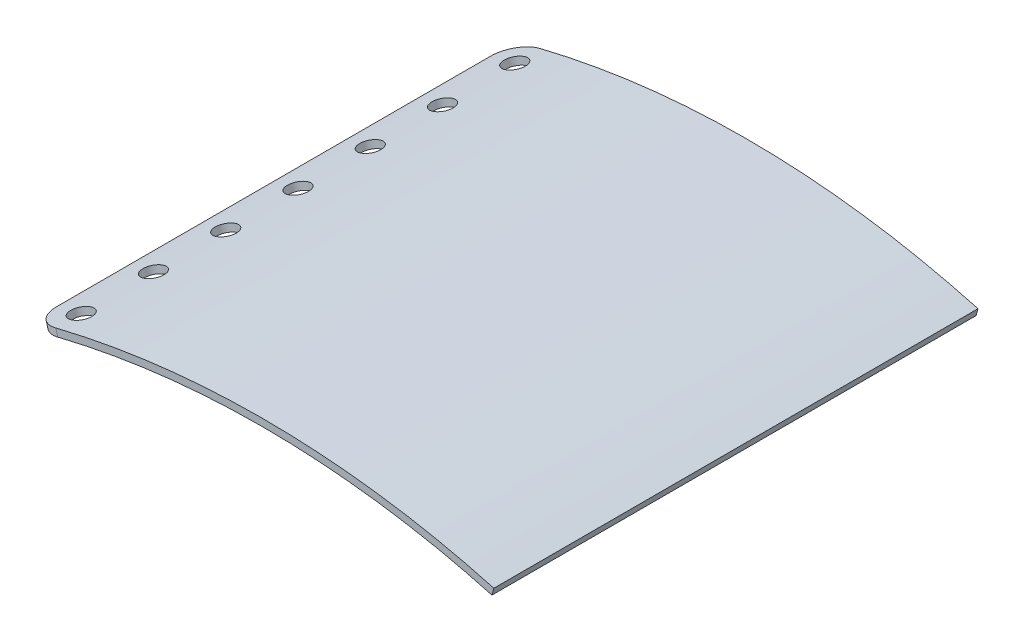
ISO-10303-21;
HEADER;
FILE_DESCRIPTION(('STEP AP214'),'2;1');
FILE_NAME('part.step','',(''),(''),'','','');
FILE_SCHEMA(('AUTOMOTIVE_DESIGN { 1 0 10303 214 1 1 1 1 }'));
ENDSEC;
DATA;
#1=APPLICATION_CONTEXT('core data for automotive mechanical design processes');
#2=APPLICATION_PROTOCOL_DEFINITION('international standard','automotive_design',2000,#1);
#3=PRODUCT_CONTEXT('',#1,'mechanical');
#4=PRODUCT('Part','Part','',(#3));
#5=PRODUCT_RELATED_PRODUCT_CATEGORY('part','',(#4));
#6=PRODUCT_DEFINITION_FORMATION('','',#4);
#7=PRODUCT_DEFINITION_CONTEXT('part definition',#1,'design');
#8=PRODUCT_DEFINITION('design','',#6,#7);
#9=PRODUCT_DEFINITION_SHAPE('','',#8);
#10=(LENGTH_UNIT() NAMED_UNIT(*) SI_UNIT(.MILLI.,.METRE.));
#11=(NAMED_UNIT(*) PLANE_ANGLE_UNIT() SI_UNIT($,.RADIAN.));
#12=(NAMED_UNIT(*) SI_UNIT($,.STERADIAN.) SOLID_ANGLE_UNIT());
#13=UNCERTAINTY_MEASURE_WITH_UNIT(LENGTH_MEASURE(1.E-05),#10,'distance_accuracy_value','');
#14=(GEOMETRIC_REPRESENTATION_CONTEXT(3) GLOBAL_UNCERTAINTY_ASSIGNED_CONTEXT((#13)) GLOBAL_UNIT_ASSIGNED_CONTEXT((#10,
#11,#12)) REPRESENTATION_CONTEXT('',''));
#15=CARTESIAN_POINT('',(0.,0.,0.));
#16=DIRECTION('',(0.,0.,1.));
#17=DIRECTION('',(1.,0.,0.));
#18=AXIS2_PLACEMENT_3D('',#15,#16,#17);
#19=CARTESIAN_POINT('',(32.,-115.654658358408,67.));
#20=DIRECTION('',(0.,0.,-1.));
#21=DIRECTION('',(-1.,0.,0.));
#22=AXIS2_PLACEMENT_3D('',#19,#20,#21);
#23=CYLINDRICAL_SURFACE('',#22,119.);
#24=CARTESIAN_POINT('',(2.1704795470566,-0.453965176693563,63.5));
#25=CARTESIAN_POINT('',(2.17048314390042,-0.453964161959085,63.584252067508));
#26=CARTESIAN_POINT('',(2.17737477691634,-0.452179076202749,63.6685651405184));
#27=CARTESIAN_POINT('',(2.20477287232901,-0.445090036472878,63.8348690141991));
#28=CARTESIAN_POINT('',(2.22529570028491,-0.439781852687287,63.9168568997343));
#29=CARTESIAN_POINT('',(2.27937692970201,-0.425819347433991,64.0760770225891));
#30=CARTESIAN_POINT('',(2.31292907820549,-0.417166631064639,64.1533115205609));
#31=CARTESIAN_POINT('',(2.39211596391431,-0.396795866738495,64.3008458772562));
#32=CARTESIAN_POINT('',(2.43774770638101,-0.385078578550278,64.3711474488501));
#33=CARTESIAN_POINT('',(2.539820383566,-0.358949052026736,64.5028562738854));
#34=CARTESIAN_POINT('',(2.59626298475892,-0.3445363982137,64.5642621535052));
#35=CARTESIAN_POINT('',(2.71836424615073,-0.313469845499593,64.6764253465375));
#36=CARTESIAN_POINT('',(2.78402326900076,-0.296815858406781,64.7271822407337));
#37=CARTESIAN_POINT('',(2.92270357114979,-0.261781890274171,64.8166045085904));
#38=CARTESIAN_POINT('',(2.99572495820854,-0.243401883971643,64.8552697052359));
#39=CARTESIAN_POINT('',(3.14706510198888,-0.2054737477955,64.9194095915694));
#40=CARTESIAN_POINT('',(3.2253838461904,-0.185925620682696,64.9448843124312));
#41=CARTESIAN_POINT('',(3.38509749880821,-0.146242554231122,64.9819189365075));
#42=CARTESIAN_POINT('',(3.46649224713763,-0.12610764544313,64.9934795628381));
#43=CARTESIAN_POINT('',(3.6300537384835,-0.0858336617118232,65.0023600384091));
#44=CARTESIAN_POINT('',(3.71222047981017,-0.0656945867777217,64.999679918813));
#45=CARTESIAN_POINT('',(3.87498805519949,-0.0259823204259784,64.9801556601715));
#46=CARTESIAN_POINT('',(3.95558897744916,-0.00640909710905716,64.9633123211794));
#47=CARTESIAN_POINT('',(4.11293769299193,0.0316343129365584,64.9159409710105));
#48=CARTESIAN_POINT('',(4.18968548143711,0.0501044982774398,64.8854129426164));
#49=CARTESIAN_POINT('',(4.33714442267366,0.0854478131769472,64.8115378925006));
#50=CARTESIAN_POINT('',(4.40785540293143,0.102320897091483,64.7681905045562));
#51=CARTESIAN_POINT('',(4.5412220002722,0.134029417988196,64.6699075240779));
#52=CARTESIAN_POINT('',(4.60387761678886,0.148864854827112,64.6149719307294));
#53=CARTESIAN_POINT('',(4.71934877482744,0.176121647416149,64.4950674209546));
#54=CARTESIAN_POINT('',(4.7721636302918,0.188542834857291,64.4300978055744));
#55=CARTESIAN_POINT('',(4.86643805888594,0.210660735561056,64.291972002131));
#56=CARTESIAN_POINT('',(4.90789763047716,0.220357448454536,64.2188158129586));
#57=CARTESIAN_POINT('',(4.97827506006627,0.236789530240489,64.0663931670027));
#58=CARTESIAN_POINT('',(5.00719289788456,0.243524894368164,63.987126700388));
#59=CARTESIAN_POINT('',(5.05165841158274,0.253872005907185,63.8247338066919));
#60=CARTESIAN_POINT('',(5.06720609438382,0.2574837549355,63.7416073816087));
#61=CARTESIAN_POINT('',(5.08448509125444,0.261497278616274,63.5738604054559));
#62=CARTESIAN_POINT('',(5.08621735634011,0.261899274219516,63.4892399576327));
#63=CARTESIAN_POINT('',(5.07581836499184,0.259484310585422,63.3209016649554));
#64=CARTESIAN_POINT('',(5.06368711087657,0.256667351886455,63.2371838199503));
#65=CARTESIAN_POINT('',(5.02590939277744,0.247881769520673,63.0730299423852));
#66=CARTESIAN_POINT('',(5.00026335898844,0.241913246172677,62.9925938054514));
#67=CARTESIAN_POINT('',(4.93619094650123,0.226967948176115,62.8372834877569));
#68=CARTESIAN_POINT('',(4.89776456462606,0.217991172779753,62.7624093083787));
#69=CARTESIAN_POINT('',(4.80922875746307,0.197247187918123,62.6203438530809));
#70=CARTESIAN_POINT('',(4.75911869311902,0.185479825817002,62.5531529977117));
#71=CARTESIAN_POINT('',(4.64864938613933,0.159446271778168,62.4283657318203));
#72=CARTESIAN_POINT('',(4.58829013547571,0.145180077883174,62.3707693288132));
#73=CARTESIAN_POINT('',(4.45904261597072,0.11450882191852,62.2668027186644));
#74=CARTESIAN_POINT('',(4.39015386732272,0.098103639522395,62.2204331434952));
#75=CARTESIAN_POINT('',(4.2458153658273,0.0635801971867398,62.1402408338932));
#76=CARTESIAN_POINT('',(4.17036562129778,0.0454619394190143,62.106418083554));
#77=CARTESIAN_POINT('',(4.01505715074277,0.00799485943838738,62.0522806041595));
#78=CARTESIAN_POINT('',(3.93519855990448,-0.0113539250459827,62.0319654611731));
#79=CARTESIAN_POINT('',(3.77334232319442,-0.0507538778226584,62.0054185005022));
#80=CARTESIAN_POINT('',(3.69134467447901,-0.0708050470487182,61.9991867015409));
#81=CARTESIAN_POINT('',(3.52754593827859,-0.11104550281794,62.0009834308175));
#82=CARTESIAN_POINT('',(3.44574483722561,-0.131234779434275,62.0090109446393));
#83=CARTESIAN_POINT('',(3.28465323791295,-0.17117144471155,62.039096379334));
#84=CARTESIAN_POINT('',(3.20536274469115,-0.190918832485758,62.061154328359));
#85=CARTESIAN_POINT('',(3.05153629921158,-0.229389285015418,62.1186747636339));
#86=CARTESIAN_POINT('',(2.9770004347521,-0.248112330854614,62.154137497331));
#87=CARTESIAN_POINT('',(2.83479477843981,-0.283968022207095,62.2374592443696));
#88=CARTESIAN_POINT('',(2.76712472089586,-0.301100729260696,62.2853177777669));
#89=CARTESIAN_POINT('',(2.640559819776,-0.333248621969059,62.3920708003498));
#90=CARTESIAN_POINT('',(2.58166466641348,-0.348263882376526,62.4509648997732));
#91=CARTESIAN_POINT('',(2.47429332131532,-0.37571090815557,62.5781378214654));
#92=CARTESIAN_POINT('',(2.42581972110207,-0.388142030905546,62.6464189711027));
#93=CARTESIAN_POINT('',(2.34065544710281,-0.410026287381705,62.7904422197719));
#94=CARTESIAN_POINT('',(2.30397076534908,-0.419477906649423,62.8661880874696));
#95=CARTESIAN_POINT('',(2.24348444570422,-0.435082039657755,63.0229056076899));
#96=CARTESIAN_POINT('',(2.2196673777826,-0.441238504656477,63.1038708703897));
#97=CARTESIAN_POINT('',(2.19192759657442,-0.448413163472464,63.2377927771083));
#98=CARTESIAN_POINT('',(2.18389455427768,-0.450492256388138,63.2898793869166));
#99=CARTESIAN_POINT('',(2.17316940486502,-0.453268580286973,63.3946360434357));
#100=CARTESIAN_POINT('',(2.17047729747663,-0.453965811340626,63.4473060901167));
#101=CARTESIAN_POINT('',(2.1704795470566,-0.453965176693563,63.5));
#102=B_SPLINE_CURVE_WITH_KNOTS('',3,(#24,#25,#26,#27,#28,#29,#30,#31,#32,#33,#34,#35,#36,#37,
#38,#39,#40,#41,#42,#43,#44,#45,#46,#47,#48,#49,#50,#51,#52,#53,#54,#55,#56,#57,#58,#59,#60,#61,
#62,#63,#64,#65,#66,#67,#68,#69,#70,#71,#72,#73,#74,#75,#76,#77,#78,#79,#80,#81,#82,#83,#84,#85,
#86,#87,#88,#89,#90,#91,#92,#93,#94,#95,#96,#97,#98,#99,#100,#101),.UNSPECIFIED.,.T.,.F.,(4,2,2,
2,2,2,2,2,2,2,2,2,2,2,2,2,2,2,2,2,2,2,2,2,2,2,2,2,2,2,2,2,2,2,2,2,2,2,4),(0.,0.25256386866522,
0.505431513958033,0.758177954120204,1.01086179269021,1.26358461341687,1.51631738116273,
1.76905384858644,2.02178971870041,2.27451245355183,2.52723463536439,2.77994254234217,
3.03265076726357,3.28536621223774,3.53808167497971,3.79081474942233,4.04354785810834,
4.29628137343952,4.54901475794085,4.80173074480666,5.05444668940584,5.3071545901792,
5.55986255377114,5.8125843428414,6.06530632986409,6.31804253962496,6.57077842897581,
6.82350657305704,7.07623505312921,7.32894555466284,7.58165656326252,7.83437223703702,
8.08707812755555,8.33977509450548,8.59253482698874,8.84542282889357,9.09800690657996,
9.25596835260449,9.41392979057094),.UNSPECIFIED.);
#103=CARTESIAN_POINT('',(2.1704795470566,-0.453965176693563,63.5));
#104=VERTEX_POINT('',#103);
#105=EDGE_CURVE('E203',#104,#104,#102,.T.);
#106=ORIENTED_EDGE('',*,*,#105,.T.);
#107=EDGE_LOOP('',(#106));
#108=FACE_BOUND('',#107,.T.);
#109=CARTESIAN_POINT('',(2.1704795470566,-0.453965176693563,53.5));
#110=CARTESIAN_POINT('',(2.17048314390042,-0.453964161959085,53.5842520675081));
#111=CARTESIAN_POINT('',(2.17737477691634,-0.452179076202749,53.6685651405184));
#112=CARTESIAN_POINT('',(2.20477287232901,-0.445090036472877,53.8348690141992));
#113=CARTESIAN_POINT('',(2.22529570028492,-0.439781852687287,53.9168568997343));
#114=CARTESIAN_POINT('',(2.27937692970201,-0.42581934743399,54.0760770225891));
#115=CARTESIAN_POINT('',(2.31292907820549,-0.417166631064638,54.1533115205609));
#116=CARTESIAN_POINT('',(2.39211596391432,-0.396795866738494,54.3008458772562));
#117=CARTESIAN_POINT('',(2.43774770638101,-0.385078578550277,54.3711474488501));
#118=CARTESIAN_POINT('',(2.53982038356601,-0.358949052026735,54.5028562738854));
#119=CARTESIAN_POINT('',(2.59626298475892,-0.3445363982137,54.5642621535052));
#120=CARTESIAN_POINT('',(2.71836424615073,-0.313469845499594,54.6764253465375));
#121=CARTESIAN_POINT('',(2.78402326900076,-0.296815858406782,54.7271822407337));
#122=CARTESIAN_POINT('',(2.92270357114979,-0.261781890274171,54.8166045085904));
#123=CARTESIAN_POINT('',(2.99572495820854,-0.243401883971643,54.8552697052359));
#124=CARTESIAN_POINT('',(3.14706510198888,-0.205473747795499,54.9194095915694));
#125=CARTESIAN_POINT('',(3.22538384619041,-0.185925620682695,54.9448843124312));
#126=CARTESIAN_POINT('',(3.38509749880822,-0.146242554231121,54.9819189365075));
#127=CARTESIAN_POINT('',(3.46649224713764,-0.126107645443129,54.9934795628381));
#128=CARTESIAN_POINT('',(3.63005373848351,-0.0858336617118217,55.0023600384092));
#129=CARTESIAN_POINT('',(3.71222047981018,-0.06569458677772,54.999679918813));
#130=CARTESIAN_POINT('',(3.8749880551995,-0.0259823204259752,54.9801556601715));
#131=CARTESIAN_POINT('',(3.95558897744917,-0.00640909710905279,54.9633123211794));
#132=CARTESIAN_POINT('',(4.11293769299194,0.031634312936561,54.9159409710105));
#133=CARTESIAN_POINT('',(4.18968548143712,0.0501044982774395,54.8854129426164));
#134=CARTESIAN_POINT('',(4.33714442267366,0.0854478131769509,54.8115378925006));
#135=CARTESIAN_POINT('',(4.40785540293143,0.102320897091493,54.7681905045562));
#136=CARTESIAN_POINT('',(4.54122200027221,0.134029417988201,54.6699075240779));
#137=CARTESIAN_POINT('',(4.60387761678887,0.148864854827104,54.6149719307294));
#138=CARTESIAN_POINT('',(4.71934877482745,0.176121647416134,54.4950674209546));
#139=CARTESIAN_POINT('',(4.77216363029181,0.18854283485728,54.4300978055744));
#140=CARTESIAN_POINT('',(4.86643805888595,0.210660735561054,54.291972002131));
#141=CARTESIAN_POINT('',(4.90789763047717,0.220357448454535,54.2188158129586));
#142=CARTESIAN_POINT('',(4.97827506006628,0.236789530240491,54.0663931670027));
#143=CARTESIAN_POINT('',(5.00719289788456,0.243524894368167,53.987126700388));
#144=CARTESIAN_POINT('',(5.05165841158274,0.253872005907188,53.8247338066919));
#145=CARTESIAN_POINT('',(5.06720609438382,0.257483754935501,53.7416073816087));
#146=CARTESIAN_POINT('',(5.08448509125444,0.261497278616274,53.5738604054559));
#147=CARTESIAN_POINT('',(5.08621735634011,0.261899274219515,53.4892399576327));
#148=CARTESIAN_POINT('',(5.07581836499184,0.259484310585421,53.3209016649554));
#149=CARTESIAN_POINT('',(5.06368711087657,0.256667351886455,53.2371838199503));
#150=CARTESIAN_POINT('',(5.02590939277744,0.247881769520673,53.0730299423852));
#151=CARTESIAN_POINT('',(5.00026335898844,0.241913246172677,52.9925938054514));
#152=CARTESIAN_POINT('',(4.93619094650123,0.226967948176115,52.8372834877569));
#153=CARTESIAN_POINT('',(4.89776456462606,0.217991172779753,52.7624093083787));
#154=CARTESIAN_POINT('',(4.80922875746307,0.197247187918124,52.6203438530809));
#155=CARTESIAN_POINT('',(4.75911869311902,0.185479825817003,52.5531529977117));
#156=CARTESIAN_POINT('',(4.64864938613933,0.159446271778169,52.4283657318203));
#157=CARTESIAN_POINT('',(4.58829013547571,0.145180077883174,52.3707693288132));
#158=CARTESIAN_POINT('',(4.45904261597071,0.114508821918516,52.2668027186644));
#159=CARTESIAN_POINT('',(4.39015386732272,0.0981036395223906,52.2204331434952));
#160=CARTESIAN_POINT('',(4.24581536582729,0.0635801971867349,52.1402408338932));
#161=CARTESIAN_POINT('',(4.17036562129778,0.0454619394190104,52.106418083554));
#162=CARTESIAN_POINT('',(4.01505715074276,0.0079948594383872,52.0522806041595));
#163=CARTESIAN_POINT('',(3.93519855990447,-0.0113539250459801,52.0319654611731));
#164=CARTESIAN_POINT('',(3.7733423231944,-0.050753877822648,52.0054185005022));
#165=CARTESIAN_POINT('',(3.691344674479,-0.0708050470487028,51.9991867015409));
#166=CARTESIAN_POINT('',(3.52754593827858,-0.111045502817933,52.0009834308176));
#167=CARTESIAN_POINT('',(3.4457448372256,-0.131234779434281,52.0090109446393));
#168=CARTESIAN_POINT('',(3.28465323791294,-0.171171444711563,52.039096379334));
#169=CARTESIAN_POINT('',(3.20536274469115,-0.190918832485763,52.061154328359));
#170=CARTESIAN_POINT('',(3.05153629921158,-0.229389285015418,52.1186747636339));
#171=CARTESIAN_POINT('',(2.97700043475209,-0.248112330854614,52.154137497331));
#172=CARTESIAN_POINT('',(2.8347947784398,-0.283968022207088,52.2374592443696));
#173=CARTESIAN_POINT('',(2.76712472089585,-0.301100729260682,52.2853177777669));
#174=CARTESIAN_POINT('',(2.640559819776,-0.33324862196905,52.3920708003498));
#175=CARTESIAN_POINT('',(2.58166466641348,-0.348263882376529,52.4509648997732));
#176=CARTESIAN_POINT('',(2.47429332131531,-0.375710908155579,52.5781378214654));
#177=CARTESIAN_POINT('',(2.42581972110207,-0.388142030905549,52.6464189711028));
#178=CARTESIAN_POINT('',(2.34065544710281,-0.410026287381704,52.7904422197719));
#179=CARTESIAN_POINT('',(2.30397076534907,-0.419477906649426,52.8661880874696));
#180=CARTESIAN_POINT('',(2.24348444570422,-0.435082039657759,53.0229056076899));
#181=CARTESIAN_POINT('',(2.2196673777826,-0.441238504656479,53.1038708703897));
#182=CARTESIAN_POINT('',(2.19192759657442,-0.448413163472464,53.2377927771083));
#183=CARTESIAN_POINT('',(2.18389455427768,-0.450492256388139,53.2898793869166));
#184=CARTESIAN_POINT('',(2.17316940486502,-0.453268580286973,53.3946360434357));
#185=CARTESIAN_POINT('',(2.17047729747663,-0.453965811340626,53.4473060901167));
#186=CARTESIAN_POINT('',(2.1704795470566,-0.453965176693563,53.5));
#187=B_SPLINE_CURVE_WITH_KNOTS('',3,(#109,#110,#111,#112,#113,#114,#115,#116,#117,#118,#119,
#120,#121,#122,#123,#124,#125,#126,#127,#128,#129,#130,#131,#132,#133,#134,#135,#136,#137,#138,
#139,#140,#141,#142,#143,#144,#145,#146,#147,#148,#149,#150,#151,#152,#153,#154,#155,#156,#157,
#158,#159,#160,#161,#162,#163,#164,#165,#166,#167,#168,#169,#170,#171,#172,#173,#174,#175,#176,
#177,#178,#179,#180,#181,#182,#183,#184,#185,#186),.UNSPECIFIED.,.T.,.F.,(4,2,2,2,2,2,2,2,2,2,2,
2,2,2,2,2,2,2,2,2,2,2,2,2,2,2,2,2,2,2,2,2,2,2,2,2,2,2,4),(0.,0.252563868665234,0.50543151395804,
0.758177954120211,1.01086179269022,1.26358461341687,1.51631738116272,1.76905384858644,
2.02178971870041,2.27451245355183,2.5272346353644,2.77994254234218,3.03265076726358,
3.28536621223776,3.53808167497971,3.79081474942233,4.04354785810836,4.29628137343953,
4.54901475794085,4.80173074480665,5.05444668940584,5.30715459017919,5.55986255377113,
5.81258434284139,6.0653063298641,6.31804253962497,6.57077842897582,6.82350657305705,
7.07623505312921,7.32894555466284,7.58165656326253,7.83437223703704,8.08707812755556,
8.33977509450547,8.59253482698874,8.84542282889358,9.09800690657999,9.25596835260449,
9.41392979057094),.UNSPECIFIED.);
#188=CARTESIAN_POINT('',(2.1704795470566,-0.453965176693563,53.5));
#189=VERTEX_POINT('',#188);
#190=EDGE_CURVE('E197',#189,#189,#187,.T.);
#191=ORIENTED_EDGE('',*,*,#190,.T.);
#192=EDGE_LOOP('',(#191));
#193=FACE_BOUND('',#192,.T.);
#194=CARTESIAN_POINT('',(2.1704795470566,-0.453965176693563,43.5));
#195=CARTESIAN_POINT('',(2.17048314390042,-0.453964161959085,43.5842520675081));
#196=CARTESIAN_POINT('',(2.17737477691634,-0.452179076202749,43.6685651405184));
#197=CARTESIAN_POINT('',(2.20477287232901,-0.445090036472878,43.8348690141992));
#198=CARTESIAN_POINT('',(2.22529570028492,-0.439781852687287,43.9168568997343));
#199=CARTESIAN_POINT('',(2.27937692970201,-0.425819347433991,44.0760770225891));
#200=CARTESIAN_POINT('',(2.31292907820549,-0.417166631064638,44.1533115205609));
#201=CARTESIAN_POINT('',(2.39211596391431,-0.396795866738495,44.3008458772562));
#202=CARTESIAN_POINT('',(2.43774770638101,-0.385078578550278,44.3711474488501));
#203=CARTESIAN_POINT('',(2.539820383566,-0.358949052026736,44.5028562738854));
#204=CARTESIAN_POINT('',(2.59626298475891,-0.344536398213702,44.5642621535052));
#205=CARTESIAN_POINT('',(2.71836424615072,-0.313469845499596,44.6764253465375));
#206=CARTESIAN_POINT('',(2.78402326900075,-0.296815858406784,44.7271822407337));
#207=CARTESIAN_POINT('',(2.92270357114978,-0.261781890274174,44.8166045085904));
#208=CARTESIAN_POINT('',(2.99572495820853,-0.243401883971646,44.8552697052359));
#209=CARTESIAN_POINT('',(3.14706510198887,-0.205473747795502,44.9194095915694));
#210=CARTESIAN_POINT('',(3.2253838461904,-0.185925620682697,44.9448843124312));
#211=CARTESIAN_POINT('',(3.38509749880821,-0.146242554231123,44.9819189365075));
#212=CARTESIAN_POINT('',(3.46649224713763,-0.126107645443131,44.9934795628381));
#213=CARTESIAN_POINT('',(3.63005373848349,-0.085833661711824,45.0023600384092));
#214=CARTESIAN_POINT('',(3.71222047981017,-0.0656945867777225,44.999679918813));
#215=CARTESIAN_POINT('',(3.87498805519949,-0.0259823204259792,44.9801556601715));
#216=CARTESIAN_POINT('',(3.95558897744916,-0.00640909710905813,44.9633123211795));
#217=CARTESIAN_POINT('',(4.11293769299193,0.0316343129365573,44.9159409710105));
#218=CARTESIAN_POINT('',(4.18968548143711,0.0501044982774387,44.8854129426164));
#219=CARTESIAN_POINT('',(4.33714442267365,0.0854478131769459,44.8115378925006));
#220=CARTESIAN_POINT('',(4.40785540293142,0.102320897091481,44.7681905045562));
#221=CARTESIAN_POINT('',(4.5412220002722,0.134029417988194,44.6699075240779));
#222=CARTESIAN_POINT('',(4.60387761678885,0.14886485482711,44.6149719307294));
#223=CARTESIAN_POINT('',(4.71934877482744,0.176121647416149,44.4950674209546));
#224=CARTESIAN_POINT('',(4.7721636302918,0.18854283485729,44.4300978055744));
#225=CARTESIAN_POINT('',(4.86643805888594,0.210660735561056,44.291972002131));
#226=CARTESIAN_POINT('',(4.90789763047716,0.220357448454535,44.2188158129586));
#227=CARTESIAN_POINT('',(4.97827506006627,0.236789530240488,44.0663931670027));
#228=CARTESIAN_POINT('',(5.00719289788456,0.243524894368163,43.987126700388));
#229=CARTESIAN_POINT('',(5.05165841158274,0.253872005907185,43.8247338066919));
#230=CARTESIAN_POINT('',(5.06720609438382,0.257483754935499,43.7416073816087));
#231=CARTESIAN_POINT('',(5.08448509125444,0.261497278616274,43.5738604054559));
#232=CARTESIAN_POINT('',(5.08621735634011,0.261899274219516,43.4892399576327));
#233=CARTESIAN_POINT('',(5.07581836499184,0.259484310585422,43.3209016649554));
#234=CARTESIAN_POINT('',(5.06368711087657,0.256667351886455,43.2371838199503));
#235=CARTESIAN_POINT('',(5.02590939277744,0.247881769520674,43.0730299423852));
#236=CARTESIAN_POINT('',(5.00026335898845,0.24191324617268,42.9925938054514));
#237=CARTESIAN_POINT('',(4.93619094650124,0.226967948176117,42.8372834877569));
#238=CARTESIAN_POINT('',(4.89776456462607,0.217991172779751,42.7624093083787));
#239=CARTESIAN_POINT('',(4.80922875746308,0.197247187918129,42.6203438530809));
#240=CARTESIAN_POINT('',(4.75911869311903,0.185479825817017,42.5531529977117));
#241=CARTESIAN_POINT('',(4.64864938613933,0.159446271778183,42.4283657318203));
#242=CARTESIAN_POINT('',(4.58829013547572,0.145180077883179,42.3707693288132));
#243=CARTESIAN_POINT('',(4.45904261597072,0.114508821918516,42.2668027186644));
#244=CARTESIAN_POINT('',(4.39015386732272,0.0981036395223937,42.2204331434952));
#245=CARTESIAN_POINT('',(4.2458153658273,0.0635801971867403,42.1402408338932));
#246=CARTESIAN_POINT('',(4.17036562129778,0.0454619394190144,42.106418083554));
#247=CARTESIAN_POINT('',(4.01505715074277,0.00799485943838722,42.0522806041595));
#248=CARTESIAN_POINT('',(3.93519855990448,-0.0113539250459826,42.0319654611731));
#249=CARTESIAN_POINT('',(3.77334232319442,-0.0507538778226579,42.0054185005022));
#250=CARTESIAN_POINT('',(3.69134467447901,-0.0708050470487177,41.9991867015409));
#251=CARTESIAN_POINT('',(3.5275459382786,-0.111045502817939,42.0009834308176));
#252=CARTESIAN_POINT('',(3.44574483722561,-0.131234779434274,42.0090109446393));
#253=CARTESIAN_POINT('',(3.28465323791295,-0.17117144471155,42.0390963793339));
#254=CARTESIAN_POINT('',(3.20536274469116,-0.190918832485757,42.061154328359));
#255=CARTESIAN_POINT('',(3.05153629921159,-0.229389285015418,42.1186747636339));
#256=CARTESIAN_POINT('',(2.9770004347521,-0.248112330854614,42.154137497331));
#257=CARTESIAN_POINT('',(2.83479477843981,-0.283968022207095,42.2374592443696));
#258=CARTESIAN_POINT('',(2.76712472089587,-0.301100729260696,42.2853177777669));
#259=CARTESIAN_POINT('',(2.640559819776,-0.333248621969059,42.3920708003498));
#260=CARTESIAN_POINT('',(2.58166466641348,-0.348263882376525,42.4509648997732));
#261=CARTESIAN_POINT('',(2.47429332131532,-0.37571090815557,42.5781378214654));
#262=CARTESIAN_POINT('',(2.42581972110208,-0.388142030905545,42.6464189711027));
#263=CARTESIAN_POINT('',(2.34065544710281,-0.410026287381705,42.7904422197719));
#264=CARTESIAN_POINT('',(2.30397076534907,-0.419477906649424,42.8661880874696));
#265=CARTESIAN_POINT('',(2.24348444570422,-0.435082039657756,43.0229056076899));
#266=CARTESIAN_POINT('',(2.2196673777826,-0.441238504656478,43.1038708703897));
#267=CARTESIAN_POINT('',(2.19192759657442,-0.448413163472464,43.2377927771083));
#268=CARTESIAN_POINT('',(2.18389455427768,-0.450492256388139,43.2898793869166));
#269=CARTESIAN_POINT('',(2.17316940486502,-0.453268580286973,43.3946360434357));
#270=CARTESIAN_POINT('',(2.17047729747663,-0.453965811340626,43.4473060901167));
#271=CARTESIAN_POINT('',(2.1704795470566,-0.453965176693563,43.5));
#272=B_SPLINE_CURVE_WITH_KNOTS('',3,(#194,#195,#196,#197,#198,#199,#200,#201,#202,#203,#204,
#205,#206,#207,#208,#209,#210,#211,#212,#213,#214,#215,#216,#217,#218,#219,#220,#221,#222,#223,
#224,#225,#226,#227,#228,#229,#230,#231,#232,#233,#234,#235,#236,#237,#238,#239,#240,#241,#242,
#243,#244,#245,#246,#247,#248,#249,#250,#251,#252,#253,#254,#255,#256,#257,#258,#259,#260,#261,
#262,#263,#264,#265,#266,#267,#268,#269,#270,#271),.UNSPECIFIED.,.T.,.F.,(4,2,2,2,2,2,2,2,2,2,2,
2,2,2,2,2,2,2,2,2,2,2,2,2,2,2,2,2,2,2,2,2,2,2,2,2,2,2,4),(0.,0.252563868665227,
0.505431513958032,0.758177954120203,1.01086179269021,1.26358461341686,1.51631738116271,
1.76905384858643,2.0217897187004,2.27451245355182,2.52723463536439,2.77994254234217,
3.03265076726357,3.28536621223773,3.5380816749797,3.79081474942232,4.04354785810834,
4.29628137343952,4.54901475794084,4.80173074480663,5.05444668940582,5.30715459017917,
5.55986255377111,5.81258434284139,6.06530632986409,6.31804253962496,6.57077842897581,
6.82350657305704,7.0762350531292,7.32894555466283,7.58165656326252,7.83437223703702,
8.08707812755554,8.33977509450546,8.59253482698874,8.84542282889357,9.09800690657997,
9.25596835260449,9.41392979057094),.UNSPECIFIED.);
#273=CARTESIAN_POINT('',(2.1704795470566,-0.453965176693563,43.5));
#274=VERTEX_POINT('',#273);
#275=EDGE_CURVE('E188',#274,#274,#272,.T.);
#276=ORIENTED_EDGE('',*,*,#275,.T.);
#277=EDGE_LOOP('',(#276));
#278=FACE_BOUND('',#277,.T.);
#279=CARTESIAN_POINT('',(2.1704795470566,-0.453965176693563,33.5));
#280=CARTESIAN_POINT('',(2.17048314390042,-0.453964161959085,33.5842520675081));
#281=CARTESIAN_POINT('',(2.17737477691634,-0.452179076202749,33.6685651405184));
#282=CARTESIAN_POINT('',(2.20477287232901,-0.445090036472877,33.8348690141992));
#283=CARTESIAN_POINT('',(2.22529570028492,-0.439781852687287,33.9168568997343));
#284=CARTESIAN_POINT('',(2.27937692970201,-0.42581934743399,34.0760770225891));
#285=CARTESIAN_POINT('',(2.31292907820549,-0.417166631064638,34.1533115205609));
#286=CARTESIAN_POINT('',(2.39211596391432,-0.396795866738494,34.3008458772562));
#287=CARTESIAN_POINT('',(2.43774770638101,-0.385078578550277,34.3711474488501));
#288=CARTESIAN_POINT('',(2.53982038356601,-0.358949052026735,34.5028562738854));
#289=CARTESIAN_POINT('',(2.59626298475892,-0.3445363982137,34.5642621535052));
#290=CARTESIAN_POINT('',(2.71836424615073,-0.313469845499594,34.6764253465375));
#291=CARTESIAN_POINT('',(2.78402326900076,-0.296815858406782,34.7271822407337));
#292=CARTESIAN_POINT('',(2.92270357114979,-0.261781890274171,34.8166045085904));
#293=CARTESIAN_POINT('',(2.99572495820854,-0.243401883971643,34.8552697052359));
#294=CARTESIAN_POINT('',(3.14706510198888,-0.205473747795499,34.9194095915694));
#295=CARTESIAN_POINT('',(3.22538384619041,-0.185925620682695,34.9448843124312));
#296=CARTESIAN_POINT('',(3.38509749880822,-0.146242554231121,34.9819189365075));
#297=CARTESIAN_POINT('',(3.46649224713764,-0.126107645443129,34.9934795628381));
#298=CARTESIAN_POINT('',(3.63005373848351,-0.0858336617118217,35.0023600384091));
#299=CARTESIAN_POINT('',(3.71222047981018,-0.06569458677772,34.999679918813));
#300=CARTESIAN_POINT('',(3.8749880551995,-0.0259823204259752,34.9801556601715));
#301=CARTESIAN_POINT('',(3.95558897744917,-0.00640909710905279,34.9633123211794));
#302=CARTESIAN_POINT('',(4.11293769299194,0.031634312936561,34.9159409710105));
#303=CARTESIAN_POINT('',(4.18968548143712,0.0501044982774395,34.8854129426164));
#304=CARTESIAN_POINT('',(4.33714442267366,0.0854478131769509,34.8115378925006));
#305=CARTESIAN_POINT('',(4.40785540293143,0.102320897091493,34.7681905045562));
#306=CARTESIAN_POINT('',(4.54122200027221,0.134029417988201,34.6699075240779));
#307=CARTESIAN_POINT('',(4.60387761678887,0.148864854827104,34.6149719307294));
#308=CARTESIAN_POINT('',(4.71934877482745,0.176121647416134,34.4950674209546));
#309=CARTESIAN_POINT('',(4.77216363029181,0.18854283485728,34.4300978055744));
#310=CARTESIAN_POINT('',(4.86643805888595,0.210660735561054,34.291972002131));
#311=CARTESIAN_POINT('',(4.90789763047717,0.220357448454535,34.2188158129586));
#312=CARTESIAN_POINT('',(4.97827506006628,0.236789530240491,34.0663931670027));
#313=CARTESIAN_POINT('',(5.00719289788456,0.243524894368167,33.987126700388));
#314=CARTESIAN_POINT('',(5.05165841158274,0.253872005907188,33.8247338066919));
#315=CARTESIAN_POINT('',(5.06720609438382,0.257483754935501,33.7416073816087));
#316=CARTESIAN_POINT('',(5.08448509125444,0.261497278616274,33.5738604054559));
#317=CARTESIAN_POINT('',(5.08621735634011,0.261899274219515,33.4892399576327));
#318=CARTESIAN_POINT('',(5.07581836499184,0.259484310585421,33.3209016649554));
#319=CARTESIAN_POINT('',(5.06368711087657,0.256667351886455,33.2371838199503));
#320=CARTESIAN_POINT('',(5.02590939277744,0.247881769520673,33.0730299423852));
#321=CARTESIAN_POINT('',(5.00026335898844,0.241913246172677,32.9925938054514));
#322=CARTESIAN_POINT('',(4.93619094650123,0.226967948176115,32.8372834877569));
#323=CARTESIAN_POINT('',(4.89776456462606,0.217991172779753,32.7624093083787));
#324=CARTESIAN_POINT('',(4.80922875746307,0.197247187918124,32.6203438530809));
#325=CARTESIAN_POINT('',(4.75911869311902,0.185479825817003,32.5531529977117));
#326=CARTESIAN_POINT('',(4.64864938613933,0.159446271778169,32.4283657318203));
#327=CARTESIAN_POINT('',(4.58829013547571,0.145180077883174,32.3707693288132));
#328=CARTESIAN_POINT('',(4.45904261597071,0.114508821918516,32.2668027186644));
#329=CARTESIAN_POINT('',(4.39015386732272,0.0981036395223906,32.2204331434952));
#330=CARTESIAN_POINT('',(4.24581536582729,0.0635801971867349,32.1402408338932));
#331=CARTESIAN_POINT('',(4.17036562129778,0.0454619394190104,32.106418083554));
#332=CARTESIAN_POINT('',(4.01505715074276,0.0079948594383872,32.0522806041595));
#333=CARTESIAN_POINT('',(3.93519855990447,-0.0113539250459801,32.0319654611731));
#334=CARTESIAN_POINT('',(3.7733423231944,-0.050753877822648,32.0054185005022));
#335=CARTESIAN_POINT('',(3.691344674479,-0.0708050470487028,31.9991867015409));
#336=CARTESIAN_POINT('',(3.52754593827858,-0.111045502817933,32.0009834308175));
#337=CARTESIAN_POINT('',(3.4457448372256,-0.131234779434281,32.0090109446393));
#338=CARTESIAN_POINT('',(3.28465323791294,-0.171171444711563,32.039096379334));
#339=CARTESIAN_POINT('',(3.20536274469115,-0.190918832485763,32.061154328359));
#340=CARTESIAN_POINT('',(3.05153629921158,-0.229389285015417,32.1186747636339));
#341=CARTESIAN_POINT('',(2.97700043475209,-0.248112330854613,32.154137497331));
#342=CARTESIAN_POINT('',(2.8347947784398,-0.283968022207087,32.2374592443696));
#343=CARTESIAN_POINT('',(2.76712472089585,-0.301100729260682,32.2853177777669));
#344=CARTESIAN_POINT('',(2.640559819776,-0.33324862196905,32.3920708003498));
#345=CARTESIAN_POINT('',(2.58166466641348,-0.348263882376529,32.4509648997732));
#346=CARTESIAN_POINT('',(2.47429332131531,-0.375710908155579,32.5781378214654));
#347=CARTESIAN_POINT('',(2.42581972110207,-0.388142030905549,32.6464189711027));
#348=CARTESIAN_POINT('',(2.34065544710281,-0.410026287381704,32.7904422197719));
#349=CARTESIAN_POINT('',(2.30397076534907,-0.419477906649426,32.8661880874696));
#350=CARTESIAN_POINT('',(2.24348444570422,-0.435082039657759,33.0229056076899));
#351=CARTESIAN_POINT('',(2.2196673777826,-0.441238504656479,33.1038708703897));
#352=CARTESIAN_POINT('',(2.19192759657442,-0.448413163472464,33.2377927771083));
#353=CARTESIAN_POINT('',(2.18389455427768,-0.450492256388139,33.2898793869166));
#354=CARTESIAN_POINT('',(2.17316940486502,-0.453268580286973,33.3946360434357));
#355=CARTESIAN_POINT('',(2.17047729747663,-0.453965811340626,33.4473060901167));
#356=CARTESIAN_POINT('',(2.1704795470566,-0.453965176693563,33.5));
#357=B_SPLINE_CURVE_WITH_KNOTS('',3,(#279,#280,#281,#282,#283,#284,#285,#286,#287,#288,#289,
#290,#291,#292,#293,#294,#295,#296,#297,#298,#299,#300,#301,#302,#303,#304,#305,#306,#307,#308,
#309,#310,#311,#312,#313,#314,#315,#316,#317,#318,#319,#320,#321,#322,#323,#324,#325,#326,#327,
#328,#329,#330,#331,#332,#333,#334,#335,#336,#337,#338,#339,#340,#341,#342,#343,#344,#345,#346,
#347,#348,#349,#350,#351,#352,#353,#354,#355,#356),.UNSPECIFIED.,.T.,.F.,(4,2,2,2,2,2,2,2,2,2,2,
2,2,2,2,2,2,2,2,2,2,2,2,2,2,2,2,2,2,2,2,2,2,2,2,2,2,2,4),(0.,0.252563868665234,0.50543151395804,
0.758177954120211,1.01086179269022,1.26358461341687,1.51631738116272,1.76905384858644,
2.02178971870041,2.27451245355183,2.5272346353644,2.77994254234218,3.03265076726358,
3.28536621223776,3.53808167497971,3.79081474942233,4.04354785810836,4.29628137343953,
4.54901475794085,4.80173074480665,5.05444668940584,5.30715459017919,5.55986255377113,
5.81258434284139,6.0653063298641,6.31804253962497,6.57077842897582,6.82350657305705,
7.07623505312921,7.32894555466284,7.58165656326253,7.83437223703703,8.08707812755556,
8.33977509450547,8.59253482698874,8.84542282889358,9.09800690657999,9.25596835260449,
9.41392979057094),.UNSPECIFIED.);
#358=CARTESIAN_POINT('',(2.1704795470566,-0.453965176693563,33.5));
#359=VERTEX_POINT('',#358);
#360=EDGE_CURVE('E180',#359,#359,#357,.T.);
#361=ORIENTED_EDGE('',*,*,#360,.T.);
#362=EDGE_LOOP('',(#361));
#363=FACE_BOUND('',#362,.T.);
#364=CARTESIAN_POINT('',(2.1704795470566,-0.453965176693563,23.5));
#365=CARTESIAN_POINT('',(2.17048314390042,-0.453964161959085,23.5842520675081));
#366=CARTESIAN_POINT('',(2.17737477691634,-0.452179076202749,23.6685651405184));
#367=CARTESIAN_POINT('',(2.20477287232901,-0.445090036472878,23.8348690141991));
#368=CARTESIAN_POINT('',(2.22529570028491,-0.439781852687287,23.9168568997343));
#369=CARTESIAN_POINT('',(2.27937692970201,-0.425819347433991,24.0760770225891));
#370=CARTESIAN_POINT('',(2.31292907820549,-0.417166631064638,24.1533115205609));
#371=CARTESIAN_POINT('',(2.39211596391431,-0.396795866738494,24.3008458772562));
#372=CARTESIAN_POINT('',(2.43774770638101,-0.385078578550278,24.3711474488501));
#373=CARTESIAN_POINT('',(2.539820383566,-0.358949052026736,24.5028562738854));
#374=CARTESIAN_POINT('',(2.59626298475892,-0.344536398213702,24.5642621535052));
#375=CARTESIAN_POINT('',(2.71836424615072,-0.313469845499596,24.6764253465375));
#376=CARTESIAN_POINT('',(2.78402326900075,-0.296815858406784,24.7271822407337));
#377=CARTESIAN_POINT('',(2.92270357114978,-0.261781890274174,24.8166045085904));
#378=CARTESIAN_POINT('',(2.99572495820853,-0.243401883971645,24.8552697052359));
#379=CARTESIAN_POINT('',(3.14706510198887,-0.205473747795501,24.9194095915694));
#380=CARTESIAN_POINT('',(3.2253838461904,-0.185925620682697,24.9448843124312));
#381=CARTESIAN_POINT('',(3.38509749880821,-0.146242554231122,24.9819189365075));
#382=CARTESIAN_POINT('',(3.46649224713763,-0.12610764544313,24.9934795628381));
#383=CARTESIAN_POINT('',(3.6300537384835,-0.0858336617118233,25.0023600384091));
#384=CARTESIAN_POINT('',(3.71222047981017,-0.0656945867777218,24.999679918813));
#385=CARTESIAN_POINT('',(3.87498805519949,-0.0259823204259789,24.9801556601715));
#386=CARTESIAN_POINT('',(3.95558897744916,-0.00640909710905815,24.9633123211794));
#387=CARTESIAN_POINT('',(4.11293769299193,0.031634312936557,24.9159409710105));
#388=CARTESIAN_POINT('',(4.18968548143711,0.0501044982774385,24.8854129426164));
#389=CARTESIAN_POINT('',(4.33714442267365,0.085447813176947,24.8115378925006));
#390=CARTESIAN_POINT('',(4.40785540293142,0.102320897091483,24.7681905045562));
#391=CARTESIAN_POINT('',(4.5412220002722,0.134029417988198,24.6699075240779));
#392=CARTESIAN_POINT('',(4.60387761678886,0.148864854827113,24.6149719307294));
#393=CARTESIAN_POINT('',(4.71934877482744,0.176121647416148,24.4950674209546));
#394=CARTESIAN_POINT('',(4.77216363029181,0.188542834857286,24.4300978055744));
#395=CARTESIAN_POINT('',(4.86643805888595,0.210660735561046,24.291972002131));
#396=CARTESIAN_POINT('',(4.90789763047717,0.220357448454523,24.2188158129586));
#397=CARTESIAN_POINT('',(4.97827506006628,0.236789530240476,24.0663931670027));
#398=CARTESIAN_POINT('',(5.00719289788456,0.243524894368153,23.987126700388));
#399=CARTESIAN_POINT('',(5.05165841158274,0.253872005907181,23.8247338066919));
#400=CARTESIAN_POINT('',(5.06720609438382,0.257483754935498,23.7416073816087));
#401=CARTESIAN_POINT('',(5.08448509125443,0.261497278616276,23.5738604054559));
#402=CARTESIAN_POINT('',(5.08621735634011,0.261899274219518,23.4892399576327));
#403=CARTESIAN_POINT('',(5.07581836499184,0.259484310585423,23.3209016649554));
#404=CARTESIAN_POINT('',(5.06368711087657,0.256667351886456,23.2371838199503));
#405=CARTESIAN_POINT('',(5.02590939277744,0.247881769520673,23.0730299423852));
#406=CARTESIAN_POINT('',(5.00026335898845,0.241913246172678,22.9925938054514));
#407=CARTESIAN_POINT('',(4.93619094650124,0.226967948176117,22.8372834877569));
#408=CARTESIAN_POINT('',(4.89776456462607,0.217991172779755,22.7624093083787));
#409=CARTESIAN_POINT('',(4.80922875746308,0.197247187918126,22.6203438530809));
#410=CARTESIAN_POINT('',(4.75911869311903,0.185479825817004,22.5531529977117));
#411=CARTESIAN_POINT('',(4.64864938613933,0.15944627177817,22.4283657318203));
#412=CARTESIAN_POINT('',(4.58829013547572,0.145180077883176,22.3707693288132));
#413=CARTESIAN_POINT('',(4.45904261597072,0.11450882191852,22.2668027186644));
#414=CARTESIAN_POINT('',(4.39015386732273,0.0981036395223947,22.2204331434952));
#415=CARTESIAN_POINT('',(4.2458153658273,0.063580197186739,22.1402408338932));
#416=CARTESIAN_POINT('',(4.17036562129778,0.0454619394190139,22.106418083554));
#417=CARTESIAN_POINT('',(4.01505715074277,0.00799485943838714,22.0522806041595));
#418=CARTESIAN_POINT('',(3.93519855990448,-0.011353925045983,22.0319654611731));
#419=CARTESIAN_POINT('',(3.77334232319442,-0.0507538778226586,22.0054185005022));
#420=CARTESIAN_POINT('',(3.69134467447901,-0.0708050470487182,21.9991867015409));
#421=CARTESIAN_POINT('',(3.52754593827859,-0.11104550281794,22.0009834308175));
#422=CARTESIAN_POINT('',(3.44574483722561,-0.131234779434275,22.0090109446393));
#423=CARTESIAN_POINT('',(3.28465323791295,-0.17117144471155,22.039096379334));
#424=CARTESIAN_POINT('',(3.20536274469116,-0.190918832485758,22.061154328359));
#425=CARTESIAN_POINT('',(3.05153629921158,-0.229389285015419,22.1186747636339));
#426=CARTESIAN_POINT('',(2.9770004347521,-0.248112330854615,22.154137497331));
#427=CARTESIAN_POINT('',(2.83479477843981,-0.283968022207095,22.2374592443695));
#428=CARTESIAN_POINT('',(2.76712472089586,-0.301100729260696,22.2853177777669));
#429=CARTESIAN_POINT('',(2.64055981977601,-0.333248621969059,22.3920708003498));
#430=CARTESIAN_POINT('',(2.58166466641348,-0.348263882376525,22.4509648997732));
#431=CARTESIAN_POINT('',(2.47429332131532,-0.375710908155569,22.5781378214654));
#432=CARTESIAN_POINT('',(2.42581972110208,-0.388142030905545,22.6464189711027));
#433=CARTESIAN_POINT('',(2.34065544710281,-0.410026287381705,22.7904422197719));
#434=CARTESIAN_POINT('',(2.30397076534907,-0.419477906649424,22.8661880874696));
#435=CARTESIAN_POINT('',(2.24348444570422,-0.435082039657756,23.0229056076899));
#436=CARTESIAN_POINT('',(2.2196673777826,-0.441238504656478,23.1038708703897));
#437=CARTESIAN_POINT('',(2.19192759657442,-0.448413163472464,23.2377927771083));
#438=CARTESIAN_POINT('',(2.18389455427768,-0.450492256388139,23.2898793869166));
#439=CARTESIAN_POINT('',(2.17316940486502,-0.453268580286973,23.3946360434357));
#440=CARTESIAN_POINT('',(2.17047729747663,-0.453965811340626,23.4473060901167));
#441=CARTESIAN_POINT('',(2.1704795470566,-0.453965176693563,23.5));
#442=B_SPLINE_CURVE_WITH_KNOTS('',3,(#364,#365,#366,#367,#368,#369,#370,#371,#372,#373,#374,
#375,#376,#377,#378,#379,#380,#381,#382,#383,#384,#385,#386,#387,#388,#389,#390,#391,#392,#393,
#394,#395,#396,#397,#398,#399,#400,#401,#402,#403,#404,#405,#406,#407,#408,#409,#410,#411,#412,
#413,#414,#415,#416,#417,#418,#419,#420,#421,#422,#423,#424,#425,#426,#427,#428,#429,#430,#431,
#432,#433,#434,#435,#436,#437,#438,#439,#440,#441),.UNSPECIFIED.,.T.,.F.,(4,2,2,2,2,2,2,2,2,2,2,
2,2,2,2,2,2,2,2,2,2,2,2,2,2,2,2,2,2,2,2,2,2,2,2,2,2,2,4),(0.,0.252563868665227,
0.505431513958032,0.758177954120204,1.01086179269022,1.26358461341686,1.51631738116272,
1.76905384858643,2.02178971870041,2.27451245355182,2.52723463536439,2.77994254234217,
3.03265076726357,3.28536621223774,3.5380816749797,3.79081474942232,4.04354785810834,
4.29628137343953,4.54901475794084,4.80173074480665,5.05444668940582,5.30715459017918,
5.55986255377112,5.81258434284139,6.06530632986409,6.31804253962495,6.57077842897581,
6.82350657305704,7.0762350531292,7.32894555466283,7.58165656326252,7.83437223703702,
8.08707812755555,8.33977509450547,8.59253482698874,8.84542282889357,9.09800690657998,
9.25596835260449,9.41392979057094),.UNSPECIFIED.);
#443=CARTESIAN_POINT('',(2.1704795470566,-0.453965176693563,23.5));
#444=VERTEX_POINT('',#443);
#445=EDGE_CURVE('E174',#444,#444,#442,.T.);
#446=ORIENTED_EDGE('',*,*,#445,.T.);
#447=EDGE_LOOP('',(#446));
#448=FACE_BOUND('',#447,.T.);
#449=CARTESIAN_POINT('',(2.1704795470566,-0.453965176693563,13.5));
#450=CARTESIAN_POINT('',(2.17048314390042,-0.453964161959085,13.5842520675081));
#451=CARTESIAN_POINT('',(2.17737477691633,-0.452179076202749,13.6685651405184));
#452=CARTESIAN_POINT('',(2.20477287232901,-0.445090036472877,13.8348690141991));
#453=CARTESIAN_POINT('',(2.22529570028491,-0.439781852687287,13.9168568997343));
#454=CARTESIAN_POINT('',(2.279376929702,-0.425819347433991,14.0760770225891));
#455=CARTESIAN_POINT('',(2.31292907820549,-0.417166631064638,14.1533115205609));
#456=CARTESIAN_POINT('',(2.39211596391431,-0.396795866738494,14.3008458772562));
#457=CARTESIAN_POINT('',(2.43774770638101,-0.385078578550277,14.3711474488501));
#458=CARTESIAN_POINT('',(2.539820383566,-0.358949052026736,14.5028562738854));
#459=CARTESIAN_POINT('',(2.59626298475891,-0.344536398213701,14.5642621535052));
#460=CARTESIAN_POINT('',(2.71836424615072,-0.313469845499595,14.6764253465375));
#461=CARTESIAN_POINT('',(2.78402326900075,-0.296815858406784,14.7271822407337));
#462=CARTESIAN_POINT('',(2.92270357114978,-0.261781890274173,14.8166045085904));
#463=CARTESIAN_POINT('',(2.99572495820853,-0.243401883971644,14.8552697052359));
#464=CARTESIAN_POINT('',(3.14706510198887,-0.2054737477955,14.9194095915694));
#465=CARTESIAN_POINT('',(3.2253838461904,-0.185925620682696,14.9448843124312));
#466=CARTESIAN_POINT('',(3.38509749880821,-0.146242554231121,14.9819189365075));
#467=CARTESIAN_POINT('',(3.46649224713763,-0.12610764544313,14.9934795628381));
#468=CARTESIAN_POINT('',(3.6300537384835,-0.0858336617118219,15.0023600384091));
#469=CARTESIAN_POINT('',(3.71222047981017,-0.0656945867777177,14.999679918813));
#470=CARTESIAN_POINT('',(3.87498805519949,-0.0259823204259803,14.9801556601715));
#471=CARTESIAN_POINT('',(3.95558897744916,-0.00640909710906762,14.9633123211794));
#472=CARTESIAN_POINT('',(4.11293769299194,0.0316343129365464,14.9159409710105));
#473=CARTESIAN_POINT('',(4.18968548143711,0.0501044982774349,14.8854129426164));
#474=CARTESIAN_POINT('',(4.33714442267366,0.0854478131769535,14.8115378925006));
#475=CARTESIAN_POINT('',(4.40785540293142,0.102320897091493,14.7681905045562));
#476=CARTESIAN_POINT('',(4.5412220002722,0.134029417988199,14.6699075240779));
#477=CARTESIAN_POINT('',(4.60387761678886,0.148864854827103,14.6149719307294));
#478=CARTESIAN_POINT('',(4.71934877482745,0.176121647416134,14.4950674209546));
#479=CARTESIAN_POINT('',(4.77216363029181,0.18854283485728,14.4300978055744));
#480=CARTESIAN_POINT('',(4.86643805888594,0.210660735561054,14.291972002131));
#481=CARTESIAN_POINT('',(4.90789763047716,0.220357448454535,14.2188158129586));
#482=CARTESIAN_POINT('',(4.97827506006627,0.236789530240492,14.0663931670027));
#483=CARTESIAN_POINT('',(5.00719289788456,0.243524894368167,13.987126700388));
#484=CARTESIAN_POINT('',(5.05165841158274,0.253872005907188,13.8247338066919));
#485=CARTESIAN_POINT('',(5.06720609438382,0.257483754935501,13.7416073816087));
#486=CARTESIAN_POINT('',(5.08448509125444,0.261497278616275,13.5738604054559));
#487=CARTESIAN_POINT('',(5.08621735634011,0.261899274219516,13.4892399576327));
#488=CARTESIAN_POINT('',(5.07581836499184,0.259484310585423,13.3209016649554));
#489=CARTESIAN_POINT('',(5.06368711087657,0.256667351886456,13.2371838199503));
#490=CARTESIAN_POINT('',(5.02590939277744,0.247881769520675,13.0730299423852));
#491=CARTESIAN_POINT('',(5.00026335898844,0.241913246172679,12.9925938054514));
#492=CARTESIAN_POINT('',(4.93619094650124,0.226967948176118,12.8372834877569));
#493=CARTESIAN_POINT('',(4.89776456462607,0.217991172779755,12.7624093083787));
#494=CARTESIAN_POINT('',(4.80922875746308,0.197247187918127,12.6203438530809));
#495=CARTESIAN_POINT('',(4.75911869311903,0.185479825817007,12.5531529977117));
#496=CARTESIAN_POINT('',(4.64864938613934,0.159446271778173,12.4283657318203));
#497=CARTESIAN_POINT('',(4.58829013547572,0.145180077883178,12.3707693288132));
#498=CARTESIAN_POINT('',(4.45904261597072,0.11450882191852,12.2668027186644));
#499=CARTESIAN_POINT('',(4.39015386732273,0.0981036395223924,12.2204331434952));
#500=CARTESIAN_POINT('',(4.2458153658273,0.063580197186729,12.1402408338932));
#501=CARTESIAN_POINT('',(4.17036562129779,0.0454619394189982,12.106418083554));
#502=CARTESIAN_POINT('',(4.01505715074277,0.00799485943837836,12.0522806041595));
#503=CARTESIAN_POINT('',(3.93519855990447,-0.0113539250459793,12.0319654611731));
#504=CARTESIAN_POINT('',(3.77334232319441,-0.0507538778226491,12.0054185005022));
#505=CARTESIAN_POINT('',(3.69134467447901,-0.0708050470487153,11.9991867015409));
#506=CARTESIAN_POINT('',(3.52754593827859,-0.111045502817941,12.0009834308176));
#507=CARTESIAN_POINT('',(3.44574483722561,-0.131234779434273,12.0090109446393));
#508=CARTESIAN_POINT('',(3.28465323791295,-0.171171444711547,12.039096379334));
#509=CARTESIAN_POINT('',(3.20536274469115,-0.190918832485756,12.061154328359));
#510=CARTESIAN_POINT('',(3.05153629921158,-0.229389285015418,12.1186747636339));
#511=CARTESIAN_POINT('',(2.9770004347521,-0.248112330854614,12.154137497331));
#512=CARTESIAN_POINT('',(2.83479477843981,-0.283968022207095,12.2374592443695));
#513=CARTESIAN_POINT('',(2.76712472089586,-0.301100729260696,12.2853177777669));
#514=CARTESIAN_POINT('',(2.640559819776,-0.333248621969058,12.3920708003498));
#515=CARTESIAN_POINT('',(2.58166466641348,-0.348263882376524,12.4509648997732));
#516=CARTESIAN_POINT('',(2.47429332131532,-0.375710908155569,12.5781378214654));
#517=CARTESIAN_POINT('',(2.42581972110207,-0.388142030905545,12.6464189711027));
#518=CARTESIAN_POINT('',(2.34065544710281,-0.410026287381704,12.7904422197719));
#519=CARTESIAN_POINT('',(2.30397076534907,-0.419477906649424,12.8661880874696));
#520=CARTESIAN_POINT('',(2.24348444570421,-0.435082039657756,13.0229056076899));
#521=CARTESIAN_POINT('',(2.2196673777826,-0.441238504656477,13.1038708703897));
#522=CARTESIAN_POINT('',(2.19192759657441,-0.448413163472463,13.2377927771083));
#523=CARTESIAN_POINT('',(2.18389455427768,-0.450492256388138,13.2898793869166));
#524=CARTESIAN_POINT('',(2.17316940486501,-0.453268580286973,13.3946360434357));
#525=CARTESIAN_POINT('',(2.17047729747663,-0.453965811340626,13.4473060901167));
#526=CARTESIAN_POINT('',(2.1704795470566,-0.453965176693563,13.5));
#527=B_SPLINE_CURVE_WITH_KNOTS('',3,(#449,#450,#451,#452,#453,#454,#455,#456,#457,#458,#459,
#460,#461,#462,#463,#464,#465,#466,#467,#468,#469,#470,#471,#472,#473,#474,#475,#476,#477,#478,
#479,#480,#481,#482,#483,#484,#485,#486,#487,#488,#489,#490,#491,#492,#493,#494,#495,#496,#497,
#498,#499,#500,#501,#502,#503,#504,#505,#506,#507,#508,#509,#510,#511,#512,#513,#514,#515,#516,
#517,#518,#519,#520,#521,#522,#523,#524,#525,#526),.UNSPECIFIED.,.T.,.F.,(4,2,2,2,2,2,2,2,2,2,2,
2,2,2,2,2,2,2,2,2,2,2,2,2,2,2,2,2,2,2,2,2,2,2,2,2,2,2,4),(0.,0.252563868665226,
0.505431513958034,0.758177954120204,1.01086179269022,1.26358461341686,1.51631738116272,
1.76905384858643,2.02178971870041,2.27451245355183,2.5272346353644,2.77994254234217,
3.03265076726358,3.28536621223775,3.53808167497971,3.79081474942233,4.04354785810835,
4.29628137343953,4.54901475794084,4.80173074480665,5.05444668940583,5.30715459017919,
5.55986255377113,5.81258434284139,6.0653063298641,6.31804253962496,6.57077842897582,
6.82350657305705,7.07623505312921,7.32894555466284,7.58165656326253,7.83437223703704,
8.08707812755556,8.33977509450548,8.59253482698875,8.84542282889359,9.09800690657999,
9.2559683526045,9.41392979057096),.UNSPECIFIED.);
#528=CARTESIAN_POINT('',(2.1704795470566,-0.453965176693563,13.5));
#529=VERTEX_POINT('',#528);
#530=EDGE_CURVE('E159',#529,#529,#527,.T.);
#531=ORIENTED_EDGE('',*,*,#530,.T.);
#532=EDGE_LOOP('',(#531));
#533=FACE_BOUND('',#532,.T.);
#534=CARTESIAN_POINT('',(2.1704795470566,-0.453965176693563,3.5));
#535=CARTESIAN_POINT('',(2.17048314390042,-0.453964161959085,3.58425206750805));
#536=CARTESIAN_POINT('',(2.17737477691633,-0.452179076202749,3.66856514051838));
#537=CARTESIAN_POINT('',(2.20477287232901,-0.445090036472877,3.83486901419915));
#538=CARTESIAN_POINT('',(2.22529570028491,-0.439781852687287,3.91685689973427));
#539=CARTESIAN_POINT('',(2.27937692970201,-0.42581934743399,4.07607702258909));
#540=CARTESIAN_POINT('',(2.31292907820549,-0.417166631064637,4.15331152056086));
#541=CARTESIAN_POINT('',(2.39211596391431,-0.396795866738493,4.30084587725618));
#542=CARTESIAN_POINT('',(2.43774770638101,-0.385078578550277,4.37114744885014));
#543=CARTESIAN_POINT('',(2.539820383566,-0.358949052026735,4.50285627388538));
#544=CARTESIAN_POINT('',(2.59626298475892,-0.344536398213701,4.56426215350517));
#545=CARTESIAN_POINT('',(2.71836424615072,-0.313469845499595,4.6764253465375));
#546=CARTESIAN_POINT('',(2.78402326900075,-0.296815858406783,4.72718224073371));
#547=CARTESIAN_POINT('',(2.92270357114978,-0.261781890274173,4.81660450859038));
#548=CARTESIAN_POINT('',(2.99572495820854,-0.243401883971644,4.85526970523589));
#549=CARTESIAN_POINT('',(3.14706510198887,-0.2054737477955,4.91940959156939));
#550=CARTESIAN_POINT('',(3.2253838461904,-0.185925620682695,4.94488431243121));
#551=CARTESIAN_POINT('',(3.38509749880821,-0.146242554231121,4.98191893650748));
#552=CARTESIAN_POINT('',(3.46649224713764,-0.12610764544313,4.99347956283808));
#553=CARTESIAN_POINT('',(3.6300537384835,-0.0858336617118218,5.00236003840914));
#554=CARTESIAN_POINT('',(3.71222047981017,-0.0656945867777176,4.99967991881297));
#555=CARTESIAN_POINT('',(3.87498805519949,-0.0259823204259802,4.9801556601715));
#556=CARTESIAN_POINT('',(3.95558897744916,-0.00640909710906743,4.96331232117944));
#557=CARTESIAN_POINT('',(4.11293769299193,0.0316343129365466,4.91594097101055));
#558=CARTESIAN_POINT('',(4.18968548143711,0.0501044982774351,4.88541294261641));
#559=CARTESIAN_POINT('',(4.33714442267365,0.0854478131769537,4.81153789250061));
#560=CARTESIAN_POINT('',(4.40785540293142,0.102320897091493,4.76819050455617));
#561=CARTESIAN_POINT('',(4.5412220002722,0.134029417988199,4.66990752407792));
#562=CARTESIAN_POINT('',(4.60387761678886,0.148864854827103,4.61497193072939));
#563=CARTESIAN_POINT('',(4.71934877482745,0.176121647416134,4.49506742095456));
#564=CARTESIAN_POINT('',(4.77216363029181,0.18854283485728,4.43009780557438));
#565=CARTESIAN_POINT('',(4.86643805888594,0.210660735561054,4.29197200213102));
#566=CARTESIAN_POINT('',(4.90789763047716,0.220357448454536,4.21881581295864));
#567=CARTESIAN_POINT('',(4.97827506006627,0.236789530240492,4.06639316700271));
#568=CARTESIAN_POINT('',(5.00719289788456,0.243524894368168,3.98712670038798));
#569=CARTESIAN_POINT('',(5.05165841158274,0.253872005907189,3.82473380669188));
#570=CARTESIAN_POINT('',(5.06720609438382,0.257483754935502,3.74160738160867));
#571=CARTESIAN_POINT('',(5.08448509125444,0.261497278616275,3.57386040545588));
#572=CARTESIAN_POINT('',(5.08621735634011,0.261899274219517,3.4892399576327));
#573=CARTESIAN_POINT('',(5.07581836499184,0.259484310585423,3.32090166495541));
#574=CARTESIAN_POINT('',(5.06368711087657,0.256667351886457,3.23718381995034));
#575=CARTESIAN_POINT('',(5.02590939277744,0.247881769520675,3.0730299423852));
#576=CARTESIAN_POINT('',(5.00026335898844,0.24191324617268,2.99259380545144));
#577=CARTESIAN_POINT('',(4.93619094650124,0.226967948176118,2.83728348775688));
#578=CARTESIAN_POINT('',(4.89776456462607,0.217991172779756,2.76240930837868));
#579=CARTESIAN_POINT('',(4.80922875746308,0.197247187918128,2.62034385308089));
#580=CARTESIAN_POINT('',(4.75911869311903,0.185479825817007,2.55315299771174));
#581=CARTESIAN_POINT('',(4.64864938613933,0.159446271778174,2.42836573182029));
#582=CARTESIAN_POINT('',(4.58829013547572,0.145180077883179,2.37076932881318));
#583=CARTESIAN_POINT('',(4.45904261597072,0.11450882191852,2.26680271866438));
#584=CARTESIAN_POINT('',(4.39015386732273,0.0981036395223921,2.22043314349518));
#585=CARTESIAN_POINT('',(4.2458153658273,0.0635801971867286,2.14024083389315));
#586=CARTESIAN_POINT('',(4.17036562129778,0.0454619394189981,2.10641808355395));
#587=CARTESIAN_POINT('',(4.01505715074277,0.00799485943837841,2.05228060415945));
#588=CARTESIAN_POINT('',(3.93519855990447,-0.0113539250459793,2.03196546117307));
#589=CARTESIAN_POINT('',(3.77334232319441,-0.050753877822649,2.00541850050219));
#590=CARTESIAN_POINT('',(3.69134467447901,-0.0708050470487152,1.99918670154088));
#591=CARTESIAN_POINT('',(3.52754593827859,-0.111045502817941,2.00098343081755));
#592=CARTESIAN_POINT('',(3.44574483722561,-0.131234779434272,2.0090109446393));
#593=CARTESIAN_POINT('',(3.28465323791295,-0.171171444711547,2.03909637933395));
#594=CARTESIAN_POINT('',(3.20536274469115,-0.190918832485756,2.06115432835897));
#595=CARTESIAN_POINT('',(3.05153629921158,-0.229389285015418,2.11867476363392));
#596=CARTESIAN_POINT('',(2.97700043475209,-0.248112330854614,2.15413749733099));
#597=CARTESIAN_POINT('',(2.83479477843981,-0.283968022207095,2.23745924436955));
#598=CARTESIAN_POINT('',(2.76712472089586,-0.301100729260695,2.28531777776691));
#599=CARTESIAN_POINT('',(2.640559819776,-0.333248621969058,2.39207080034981));
#600=CARTESIAN_POINT('',(2.58166466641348,-0.348263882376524,2.45096489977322));
#601=CARTESIAN_POINT('',(2.47429332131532,-0.375710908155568,2.57813782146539));
#602=CARTESIAN_POINT('',(2.42581972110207,-0.388142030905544,2.64641897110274));
#603=CARTESIAN_POINT('',(2.34065544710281,-0.410026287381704,2.79044221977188));
#604=CARTESIAN_POINT('',(2.30397076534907,-0.419477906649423,2.86618808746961));
#605=CARTESIAN_POINT('',(2.24348444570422,-0.435082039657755,3.02290560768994));
#606=CARTESIAN_POINT('',(2.2196673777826,-0.441238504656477,3.10387087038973));
#607=CARTESIAN_POINT('',(2.19192759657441,-0.448413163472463,3.23779277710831));
#608=CARTESIAN_POINT('',(2.18389455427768,-0.450492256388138,3.28987938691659));
#609=CARTESIAN_POINT('',(2.17316940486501,-0.453268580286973,3.39463604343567));
#610=CARTESIAN_POINT('',(2.17047729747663,-0.453965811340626,3.44730609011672));
#611=CARTESIAN_POINT('',(2.1704795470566,-0.453965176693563,3.5));
#612=B_SPLINE_CURVE_WITH_KNOTS('',3,(#534,#535,#536,#537,#538,#539,#540,#541,#542,#543,#544,
#545,#546,#547,#548,#549,#550,#551,#552,#553,#554,#555,#556,#557,#558,#559,#560,#561,#562,#563,
#564,#565,#566,#567,#568,#569,#570,#571,#572,#573,#574,#575,#576,#577,#578,#579,#580,#581,#582,
#583,#584,#585,#586,#587,#588,#589,#590,#591,#592,#593,#594,#595,#596,#597,#598,#599,#600,#601,
#602,#603,#604,#605,#606,#607,#608,#609,#610,#611),.UNSPECIFIED.,.T.,.F.,(4,2,2,2,2,2,2,2,2,2,2,
2,2,2,2,2,2,2,2,2,2,2,2,2,2,2,2,2,2,2,2,2,2,2,2,2,2,2,4),(0.,0.252563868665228,
0.505431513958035,0.758177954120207,1.01086179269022,1.26358461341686,1.51631738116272,
1.76905384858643,2.02178971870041,2.27451245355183,2.5272346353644,2.77994254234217,
3.03265076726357,3.28536621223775,3.53808167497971,3.79081474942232,4.04354785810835,
4.29628137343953,4.54901475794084,4.80173074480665,5.05444668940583,5.30715459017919,
5.55986255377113,5.81258434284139,6.0653063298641,6.31804253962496,6.57077842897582,
6.82350657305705,7.07623505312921,7.32894555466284,7.58165656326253,7.83437223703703,
8.08707812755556,8.33977509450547,8.59253482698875,8.84542282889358,9.09800690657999,
9.2559683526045,9.41392979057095),.UNSPECIFIED.);
#613=CARTESIAN_POINT('',(2.1704795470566,-0.453965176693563,3.5));
#614=VERTEX_POINT('',#613);
#615=EDGE_CURVE('E117',#614,#614,#612,.T.);
#616=ORIENTED_EDGE('',*,*,#615,.T.);
#617=EDGE_LOOP('',(#616));
#618=FACE_BOUND('',#617,.T.);
#619=CARTESIAN_POINT('',(32.,-115.654658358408,67.));
#620=DIRECTION('',(0.,0.,1.));
#621=DIRECTION('',(1.,0.,0.));
#622=AXIS2_PLACEMENT_3D('',#619,#620,#621);
#623=CIRCLE('',#622,119.);
#624=CARTESIAN_POINT('',(3.65365599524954,-0.0800729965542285,67.));
#625=VERTEX_POINT('',#624);
#626=CARTESIAN_POINT('',(63.7333333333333,-0.963788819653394,67.));
#627=VERTEX_POINT('',#626);
#628=EDGE_CURVE('E89',#625,#627,#623,.F.);
#629=ORIENTED_EDGE('',*,*,#628,.F.);
#630=CARTESIAN_POINT('',(3.65365599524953,-0.0800729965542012,67.));
#631=CARTESIAN_POINT('',(3.55805022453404,-0.103520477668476,67.0000094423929));
#632=CARTESIAN_POINT('',(3.46247830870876,-0.127087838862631,66.995850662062));
#633=CARTESIAN_POINT('',(3.2720750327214,-0.174288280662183,66.9792678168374));
#634=CARTESIAN_POINT('',(3.17724363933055,-0.197921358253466,66.9668441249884));
#635=CARTESIAN_POINT('',(2.98905602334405,-0.245063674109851,66.9338149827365));
#636=CARTESIAN_POINT('',(2.89569874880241,-0.268572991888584,66.9132156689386));
#637=CARTESIAN_POINT('',(2.71107640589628,-0.315298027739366,66.8640009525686));
#638=CARTESIAN_POINT('',(2.61981131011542,-0.338513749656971,66.8353856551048));
#639=CARTESIAN_POINT('',(2.35002717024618,-0.407474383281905,66.7377440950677));
#640=CARTESIAN_POINT('',(2.1754453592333,-0.452551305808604,66.6569091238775));
#641=CARTESIAN_POINT('',(1.84221052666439,-0.539335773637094,66.4661691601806));
#642=CARTESIAN_POINT('',(1.68355463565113,-0.581043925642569,66.3562694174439));
#643=CARTESIAN_POINT('',(1.38649119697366,-0.659716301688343,66.110509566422));
#644=CARTESIAN_POINT('',(1.24807886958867,-0.696681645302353,65.9746556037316));
#645=CARTESIAN_POINT('',(0.995331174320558,-0.764590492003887,65.6807985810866));
#646=CARTESIAN_POINT('',(0.881000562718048,-0.795532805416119,65.5227911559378));
#647=CARTESIAN_POINT('',(0.679597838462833,-0.850288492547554,65.1891043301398));
#648=CARTESIAN_POINT('',(0.592533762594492,-0.874099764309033,65.0134197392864));
#649=CARTESIAN_POINT('',(0.448162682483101,-0.913701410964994,64.6494265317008));
#650=CARTESIAN_POINT('',(0.39083831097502,-0.929496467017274,64.4611253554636));
#651=CARTESIAN_POINT('',(0.321746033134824,-0.948559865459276,64.1430646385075));
#652=CARTESIAN_POINT('',(0.301103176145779,-0.954264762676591,64.0153030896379));
#653=CARTESIAN_POINT('',(0.273565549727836,-0.961879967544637,63.758378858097));
#654=CARTESIAN_POINT('',(0.266651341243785,-0.963795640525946,63.6292184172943));
#655=CARTESIAN_POINT('',(0.266666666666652,-0.963788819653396,63.5));
#656=B_SPLINE_CURVE_WITH_KNOTS('',3,(#630,#631,#632,#633,#634,#635,#636,#637,#638,#639,#640,
#641,#642,#643,#644,#645,#646,#647,#648,#649,#650,#651,#652,#653,#654,#655),.UNSPECIFIED.,.F.,
.F.,(4,2,2,2,2,2,2,2,2,2,2,2,4),(0.,0.295221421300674,0.590429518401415,0.885416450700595,
1.18039951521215,1.77013662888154,2.3597672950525,2.94925851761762,3.53886605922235,
4.12864722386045,4.71808358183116,5.10597657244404,5.49331993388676),.UNSPECIFIED.);
#657=CARTESIAN_POINT('',(0.266666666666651,-0.963788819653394,63.5));
#658=VERTEX_POINT('',#657);
#659=EDGE_CURVE('E44',#625,#658,#656,.T.);
#660=ORIENTED_EDGE('',*,*,#659,.T.);
#661=DIRECTION('',(0.,0.,-1.));
#662=VECTOR('',#661,1.);
#663=CARTESIAN_POINT('',(0.266666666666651,-0.963788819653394,67.));
#664=LINE('',#663,#662);
#665=CARTESIAN_POINT('',(0.266666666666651,-0.963788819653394,3.5));
#666=VERTEX_POINT('',#665);
#667=EDGE_CURVE('E111',#658,#666,#664,.T.);
#668=ORIENTED_EDGE('',*,*,#667,.T.);
#669=CARTESIAN_POINT('',(0.266666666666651,-0.963788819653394,3.5));
#670=CARTESIAN_POINT('',(0.266657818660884,-0.963792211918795,3.40155768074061));
#671=CARTESIAN_POINT('',(0.270669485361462,-0.962681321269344,3.30311983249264));
#672=CARTESIAN_POINT('',(0.286665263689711,-0.958256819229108,3.10694842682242));
#673=CARTESIAN_POINT('',(0.298648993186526,-0.954943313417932,3.00921483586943));
#674=CARTESIAN_POINT('',(0.330508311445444,-0.946142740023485,2.81521087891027));
#675=CARTESIAN_POINT('',(0.350377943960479,-0.940657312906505,2.71893946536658));
#676=CARTESIAN_POINT('',(0.397851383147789,-0.927570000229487,2.5284987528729));
#677=CARTESIAN_POINT('',(0.425455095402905,-0.919968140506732,2.4343294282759));
#678=CARTESIAN_POINT('',(0.519650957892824,-0.894073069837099,2.15588312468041));
#679=CARTESIAN_POINT('',(0.597640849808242,-0.872686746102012,1.97558893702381));
#680=CARTESIAN_POINT('',(0.781723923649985,-0.822483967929,1.63126916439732));
#681=CARTESIAN_POINT('',(0.887812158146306,-0.793668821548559,1.4672407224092));
#682=CARTESIAN_POINT('',(1.12517152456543,-0.72963916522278,1.15994723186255));
#683=CARTESIAN_POINT('',(1.25644149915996,-0.694424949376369,1.01668122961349));
#684=CARTESIAN_POINT('',(1.54052975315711,-0.618828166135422,0.754980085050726));
#685=CARTESIAN_POINT('',(1.69335216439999,-0.578444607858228,0.63654971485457));
#686=CARTESIAN_POINT('',(2.0162311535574,-0.493894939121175,0.427905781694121));
#687=CARTESIAN_POINT('',(2.18628846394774,-0.449728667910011,0.337693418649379));
#688=CARTESIAN_POINT('',(2.53883042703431,-0.359070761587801,0.188084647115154));
#689=CARTESIAN_POINT('',(2.72130780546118,-0.312580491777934,0.128670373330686));
#690=CARTESIAN_POINT('',(3.02968551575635,-0.234829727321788,0.0570700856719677));
#691=CARTESIAN_POINT('',(3.15358565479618,-0.203799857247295,0.0356807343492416));
#692=CARTESIAN_POINT('',(3.40284159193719,-0.14180553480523,0.00714751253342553));
#693=CARTESIAN_POINT('',(3.52819506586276,-0.110841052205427,-1.66007427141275E-05));
#694=CARTESIAN_POINT('',(3.65365599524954,-0.0800729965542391,0.));
#695=B_SPLINE_CURVE_WITH_KNOTS('',3,(#669,#670,#671,#672,#673,#674,#675,#676,#677,#678,#679,
#680,#681,#682,#683,#684,#685,#686,#687,#688,#689,#690,#691,#692,#693,#694),.UNSPECIFIED.,.F.,
.F.,(4,2,2,2,2,2,2,2,2,2,2,2,4),(0.,0.295230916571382,0.590447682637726,0.885441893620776,
1.18043250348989,1.77017666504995,2.35981705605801,2.94943035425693,3.53915684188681,
4.12890840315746,4.7183174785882,5.10609460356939,5.49331951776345),.UNSPECIFIED.);
#696=CARTESIAN_POINT('',(3.65365599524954,-0.0800729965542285,0.));
#697=VERTEX_POINT('',#696);
#698=EDGE_CURVE('E51',#666,#697,#695,.T.);
#699=ORIENTED_EDGE('',*,*,#698,.T.);
#700=CARTESIAN_POINT('',(32.,-115.654658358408,0.));
#701=DIRECTION('',(0.,0.,1.));
#702=DIRECTION('',(1.,0.,0.));
#703=AXIS2_PLACEMENT_3D('',#700,#701,#702);
#704=CIRCLE('',#703,119.);
#705=CARTESIAN_POINT('',(63.7333333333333,-0.963788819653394,0.));
#706=VERTEX_POINT('',#705);
#707=EDGE_CURVE('E99',#697,#706,#704,.F.);
#708=ORIENTED_EDGE('',*,*,#707,.T.);
#709=DIRECTION('',(0.,0.,-1.));
#710=VECTOR('',#709,1.);
#711=CARTESIAN_POINT('',(63.7333333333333,-0.963788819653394,67.));
#712=LINE('',#711,#710);
#713=EDGE_CURVE('E98',#627,#706,#712,.T.);
#714=ORIENTED_EDGE('',*,*,#713,.F.);
#715=EDGE_LOOP('',(#629,#660,#668,#699,#708,#714));
#716=FACE_BOUND('',#715,.T.);
#717=ADVANCED_FACE('F35',(#108,#193,#278,#363,#448,#533,#618,#716),#23,.F.);
#718=CARTESIAN_POINT('',(64.,0.,67.));
#719=DIRECTION('',(0.963788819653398,-0.266666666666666,0.));
#720=DIRECTION('',(0.266666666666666,0.963788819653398,0.));
#721=AXIS2_PLACEMENT_3D('',#718,#719,#720);
#722=PLANE('',#721);
#723=DIRECTION('',(-0.266666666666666,-0.963788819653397,0.));
#724=VECTOR('',#723,1.);
#725=CARTESIAN_POINT('',(64.,0.,0.));
#726=LINE('',#725,#724);
#727=CARTESIAN_POINT('',(64.,0.,0.));
#728=VERTEX_POINT('',#727);
#729=EDGE_CURVE('E116',#728,#706,#726,.T.);
#730=ORIENTED_EDGE('',*,*,#729,.F.);
#731=DIRECTION('',(0.,0.,-1.));
#732=VECTOR('',#731,1.);
#733=CARTESIAN_POINT('',(64.,0.,67.));
#734=LINE('',#733,#732);
#735=CARTESIAN_POINT('',(64.,0.,67.));
#736=VERTEX_POINT('',#735);
#737=EDGE_CURVE('E104',#736,#728,#734,.T.);
#738=ORIENTED_EDGE('',*,*,#737,.F.);
#739=DIRECTION('',(-0.266666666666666,-0.963788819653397,0.));
#740=VECTOR('',#739,1.);
#741=CARTESIAN_POINT('',(64.,0.,67.));
#742=LINE('',#741,#740);
#743=EDGE_CURVE('E93',#736,#627,#742,.T.);
#744=ORIENTED_EDGE('',*,*,#743,.T.);
#745=ORIENTED_EDGE('',*,*,#713,.T.);
#746=EDGE_LOOP('',(#730,#738,#744,#745));
#747=FACE_BOUND('',#746,.T.);
#748=ADVANCED_FACE('F107',(#747),#722,.T.);
#749=CARTESIAN_POINT('',(32.,-115.654658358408,67.));
#750=DIRECTION('',(0.,0.,-1.));
#751=DIRECTION('',(-1.,0.,0.));
#752=AXIS2_PLACEMENT_3D('',#749,#750,#751);
#753=CYLINDRICAL_SURFACE('',#752,120.);
#754=CARTESIAN_POINT('',(1.93201503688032,0.517267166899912,63.5));
#755=CARTESIAN_POINT('',(1.93201863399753,0.517268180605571,63.5842521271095));
#756=CARTESIAN_POINT('',(1.93891045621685,0.519052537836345,63.6685652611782));
#757=CARTESIAN_POINT('',(1.96630929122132,0.526138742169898,63.8348692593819));
#758=CARTESIAN_POINT('',(1.98683267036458,0.531444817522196,63.9168572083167));
#759=CARTESIAN_POINT('',(2.04091530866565,0.54540196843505,64.0760774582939));
#760=CARTESIAN_POINT('',(2.0744683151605,0.554051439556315,64.1533120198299));
#761=CARTESIAN_POINT('',(2.15365713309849,0.574414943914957,64.3008464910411));
#762=CARTESIAN_POINT('',(2.19928994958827,0.586128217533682,64.3711481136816));
#763=CARTESIAN_POINT('',(2.30136483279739,0.612249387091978,64.502856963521));
#764=CARTESIAN_POINT('',(2.35780855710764,0.626657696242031,64.5642628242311));
#765=CARTESIAN_POINT('',(2.47991201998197,0.657715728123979,64.6764259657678));
#766=CARTESIAN_POINT('',(2.5455721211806,0.674365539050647,64.7271828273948));
#767=CARTESIAN_POINT('',(2.6842543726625,0.709391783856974,64.8166049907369));
#768=CARTESIAN_POINT('',(2.75727662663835,0.727768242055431,64.855270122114));
#769=CARTESIAN_POINT('',(2.90861822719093,0.765690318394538,64.9194098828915));
#770=CARTESIAN_POINT('',(2.98693756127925,0.785235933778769,64.9448845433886));
#771=CARTESIAN_POINT('',(3.14665212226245,0.824915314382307,64.9819190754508));
#772=CARTESIAN_POINT('',(3.22804719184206,0.84504904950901,64.9934796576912));
#773=CARTESIAN_POINT('',(3.39160895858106,0.885322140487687,65.0023600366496));
#774=CARTESIAN_POINT('',(3.47377565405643,0.9054614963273,64.9996798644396));
#775=CARTESIAN_POINT('',(3.63654285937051,0.945175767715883,64.9801554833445));
#776=CARTESIAN_POINT('',(3.71714345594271,0.964750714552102,64.9633120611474));
#777=CARTESIAN_POINT('',(3.87449120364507,1.00279880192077,64.9159405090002));
#778=CARTESIAN_POINT('',(3.95123834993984,1.02127194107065,64.8854123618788));
#779=CARTESIAN_POINT('',(4.09869572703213,1.05662205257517,64.8115370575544));
#780=CARTESIAN_POINT('',(4.16940578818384,1.07349898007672,64.768189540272));
#781=CARTESIAN_POINT('',(4.30277040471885,1.1052156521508,64.6699062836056));
#782=CARTESIAN_POINT('',(4.3654249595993,1.12005539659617,64.6149705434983));
#783=CARTESIAN_POINT('',(4.48089389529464,1.14732076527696,64.4950658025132));
#784=CARTESIAN_POINT('',(4.53370760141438,1.15974622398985,64.4300961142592));
#785=CARTESIAN_POINT('',(4.62797984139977,1.18187216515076,64.291970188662));
#786=CARTESIAN_POINT('',(4.66943837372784,1.19157264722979,64.2188139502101));
#787=CARTESIAN_POINT('',(4.73981394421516,1.20801133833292,64.0663912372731));
#788=CARTESIAN_POINT('',(4.76873096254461,1.21474954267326,63.9871247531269));
#789=CARTESIAN_POINT('',(4.8131951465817,1.22510108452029,63.8247318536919));
#790=CARTESIAN_POINT('',(4.82874231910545,1.22871442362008,63.7416054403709));
#791=CARTESIAN_POINT('',(4.84602066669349,1.23272969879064,63.5738584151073));
#792=CARTESIAN_POINT('',(4.84775277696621,1.23313185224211,63.4892379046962));
#793=CARTESIAN_POINT('',(4.83735381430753,1.23071574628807,63.3208995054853));
#794=CARTESIAN_POINT('',(4.82522274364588,1.22789748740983,63.2371816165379));
#795=CARTESIAN_POINT('',(4.78744568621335,1.21910798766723,63.0730276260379));
#796=CARTESIAN_POINT('',(4.76180012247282,1.21313684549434,62.992591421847));
#797=CARTESIAN_POINT('',(4.69772886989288,1.19818528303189,62.8372809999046));
#798=CARTESIAN_POINT('',(4.65930317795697,1.1892048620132,62.7624067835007));
#799=CARTESIAN_POINT('',(4.57076891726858,1.16845297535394,62.6203413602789));
#800=CARTESIAN_POINT('',(4.52065972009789,1.15668135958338,62.5531505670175));
#801=CARTESIAN_POINT('',(4.41019218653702,1.13063916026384,62.4283634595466));
#802=CARTESIAN_POINT('',(4.34983384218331,1.11636857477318,62.3707671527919));
#803=CARTESIAN_POINT('',(4.22058812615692,1.0856889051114,62.2668008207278));
#804=CARTESIAN_POINT('',(4.15170028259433,1.06927970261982,62.2204314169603));
#805=CARTESIAN_POINT('',(4.00736343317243,1.03474903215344,62.1402394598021));
#806=CARTESIAN_POINT('',(3.93191443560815,1.01662756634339,62.1064168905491));
#807=CARTESIAN_POINT('',(3.77660717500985,0.979155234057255,62.0522797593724));
#808=CARTESIAN_POINT('',(3.69674904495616,0.95980440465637,62.0319647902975));
#809=CARTESIAN_POINT('',(3.5348934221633,0.920401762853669,62.0054181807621));
#810=CARTESIAN_POINT('',(3.45289592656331,0.900349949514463,61.9991865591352));
#811=CARTESIAN_POINT('',(3.28909707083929,0.860109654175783,62.0009836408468));
#812=CARTESIAN_POINT('',(3.20729569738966,0.839921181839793,62.0090113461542));
#813=CARTESIAN_POINT('',(3.04620324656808,0.799987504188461,62.0390971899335));
#814=CARTESIAN_POINT('',(2.9669121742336,0.780242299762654,62.0611553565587));
#815=CARTESIAN_POINT('',(2.81308432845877,0.741777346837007,62.1186762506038));
#816=CARTESIAN_POINT('',(2.73854764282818,0.723057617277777,62.1541392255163));
#817=CARTESIAN_POINT('',(2.59634020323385,0.687209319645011,62.2374614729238));
#818=CARTESIAN_POINT('',(2.52866918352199,0.670080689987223,62.2853202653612));
#819=CARTESIAN_POINT('',(2.40210241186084,0.637941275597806,62.3920737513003));
#820=CARTESIAN_POINT('',(2.34320634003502,0.622930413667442,62.4509680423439));
#821=CARTESIAN_POINT('',(2.23583323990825,0.595491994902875,62.5781413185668));
#822=CARTESIAN_POINT('',(2.18735880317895,0.583065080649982,62.6464226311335));
#823=CARTESIAN_POINT('',(2.10219307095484,0.561188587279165,62.790446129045));
#824=CARTESIAN_POINT('',(2.06550776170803,0.551740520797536,62.8661920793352));
#825=CARTESIAN_POINT('',(2.00502045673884,0.536142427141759,63.0229097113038));
#826=CARTESIAN_POINT('',(1.98120303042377,0.529988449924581,63.1038750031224));
#827=CARTESIAN_POINT('',(1.95346306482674,0.522816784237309,63.237796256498));
#828=CARTESIAN_POINT('',(1.94543003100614,0.520738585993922,63.289882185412));
#829=CARTESIAN_POINT('',(1.93470489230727,0.517963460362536,63.3946374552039));
#830=CARTESIAN_POINT('',(1.93201278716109,0.517266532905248,63.4473067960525));
#831=CARTESIAN_POINT('',(1.93201503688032,0.517267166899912,63.5));
#832=B_SPLINE_CURVE_WITH_KNOTS('',3,(#754,#755,#756,#757,#758,#759,#760,#761,#762,#763,#764,
#765,#766,#767,#768,#769,#770,#771,#772,#773,#774,#775,#776,#777,#778,#779,#780,#781,#782,#783,
#784,#785,#786,#787,#788,#789,#790,#791,#792,#793,#794,#795,#796,#797,#798,#799,#800,#801,#802,
#803,#804,#805,#806,#807,#808,#809,#810,#811,#812,#813,#814,#815,#816,#817,#818,#819,#820,#821,
#822,#823,#824,#825,#826,#827,#828,#829,#830,#831),.UNSPECIFIED.,.T.,.F.,(4,2,2,2,2,2,2,2,2,2,2,
2,2,2,2,2,2,2,2,2,2,2,2,2,2,2,2,2,2,2,2,2,2,2,2,2,2,2,4),(0.,0.252564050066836,
0.505431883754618,0.758178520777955,1.01086255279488,1.26358535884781,1.51631811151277,
1.76905442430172,2.02179014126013,2.27451294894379,2.52723520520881,2.77994342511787,
3.0326519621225,3.28536759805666,3.53808324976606,3.79081622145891,4.04354922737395,
4.29628263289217,4.54901590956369,4.80173207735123,5.05444820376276,5.3071564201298,
5.55986469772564,5.81258657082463,6.06530864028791,6.31804469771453,6.57078043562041,
6.823508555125,7.07623701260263,7.32894778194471,7.58165905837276,7.83437500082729,
8.08708115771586,8.33977810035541,8.59253780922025,8.84542566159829,9.09800958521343,
9.25596891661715,9.41392824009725),.UNSPECIFIED.);
#833=CARTESIAN_POINT('',(1.93201503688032,0.517267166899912,63.5));
#834=VERTEX_POINT('',#833);
#835=EDGE_CURVE('E233',#834,#834,#832,.T.);
#836=ORIENTED_EDGE('',*,*,#835,.F.);
#837=EDGE_LOOP('',(#836));
#838=FACE_BOUND('',#837,.T.);
#839=CARTESIAN_POINT('',(1.93201503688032,0.517267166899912,53.5));
#840=CARTESIAN_POINT('',(1.93201863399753,0.517268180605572,53.5842521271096));
#841=CARTESIAN_POINT('',(1.93891045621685,0.519052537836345,53.6685652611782));
#842=CARTESIAN_POINT('',(1.96630929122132,0.526138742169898,53.8348692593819));
#843=CARTESIAN_POINT('',(1.98683267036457,0.531444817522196,53.9168572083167));
#844=CARTESIAN_POINT('',(2.04091530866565,0.54540196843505,54.0760774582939));
#845=CARTESIAN_POINT('',(2.0744683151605,0.554051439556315,54.1533120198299));
#846=CARTESIAN_POINT('',(2.15365713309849,0.574414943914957,54.3008464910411));
#847=CARTESIAN_POINT('',(2.19928994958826,0.586128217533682,54.3711481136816));
#848=CARTESIAN_POINT('',(2.30136483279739,0.612249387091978,54.502856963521));
#849=CARTESIAN_POINT('',(2.35780855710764,0.626657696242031,54.5642628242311));
#850=CARTESIAN_POINT('',(2.47991201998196,0.657715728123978,54.6764259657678));
#851=CARTESIAN_POINT('',(2.5455721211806,0.674365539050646,54.7271828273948));
#852=CARTESIAN_POINT('',(2.68425437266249,0.709391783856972,54.8166049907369));
#853=CARTESIAN_POINT('',(2.75727662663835,0.727768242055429,54.855270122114));
#854=CARTESIAN_POINT('',(2.90861822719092,0.765690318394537,54.9194098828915));
#855=CARTESIAN_POINT('',(2.98693756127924,0.785235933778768,54.9448845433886));
#856=CARTESIAN_POINT('',(3.14665212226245,0.824915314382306,54.9819190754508));
#857=CARTESIAN_POINT('',(3.22804719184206,0.845049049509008,54.9934796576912));
#858=CARTESIAN_POINT('',(3.39160895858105,0.885322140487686,55.0023600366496));
#859=CARTESIAN_POINT('',(3.47377565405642,0.905461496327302,54.9996798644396));
#860=CARTESIAN_POINT('',(3.63654285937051,0.945175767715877,54.9801554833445));
#861=CARTESIAN_POINT('',(3.71714345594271,0.964750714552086,54.9633120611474));
#862=CARTESIAN_POINT('',(3.87449120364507,1.00279880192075,54.9159405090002));
#863=CARTESIAN_POINT('',(3.95123834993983,1.02127194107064,54.8854123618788));
#864=CARTESIAN_POINT('',(4.09869572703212,1.05662205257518,54.8115370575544));
#865=CARTESIAN_POINT('',(4.16940578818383,1.07349898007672,54.768189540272));
#866=CARTESIAN_POINT('',(4.30277040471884,1.1052156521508,54.6699062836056));
#867=CARTESIAN_POINT('',(4.3654249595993,1.12005539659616,54.6149705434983));
#868=CARTESIAN_POINT('',(4.48089389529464,1.14732076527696,54.4950658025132));
#869=CARTESIAN_POINT('',(4.53370760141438,1.15974622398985,54.4300961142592));
#870=CARTESIAN_POINT('',(4.62797984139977,1.18187216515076,54.291970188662));
#871=CARTESIAN_POINT('',(4.66943837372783,1.19157264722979,54.2188139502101));
#872=CARTESIAN_POINT('',(4.73981394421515,1.20801133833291,54.0663912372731));
#873=CARTESIAN_POINT('',(4.7687309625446,1.21474954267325,53.987124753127));
#874=CARTESIAN_POINT('',(4.81319514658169,1.22510108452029,53.824731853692));
#875=CARTESIAN_POINT('',(4.82874231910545,1.22871442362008,53.7416054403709));
#876=CARTESIAN_POINT('',(4.84602066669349,1.23272969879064,53.5738584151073));
#877=CARTESIAN_POINT('',(4.84775277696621,1.23313185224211,53.4892379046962));
#878=CARTESIAN_POINT('',(4.83735381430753,1.23071574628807,53.3208995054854));
#879=CARTESIAN_POINT('',(4.82522274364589,1.22789748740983,53.2371816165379));
#880=CARTESIAN_POINT('',(4.78744568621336,1.21910798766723,53.0730276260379));
#881=CARTESIAN_POINT('',(4.76180012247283,1.21313684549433,52.992591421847));
#882=CARTESIAN_POINT('',(4.69772886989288,1.19818528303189,52.8372809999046));
#883=CARTESIAN_POINT('',(4.65930317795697,1.18920486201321,52.7624067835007));
#884=CARTESIAN_POINT('',(4.57076891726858,1.16845297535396,52.6203413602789));
#885=CARTESIAN_POINT('',(4.52065972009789,1.15668135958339,52.5531505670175));
#886=CARTESIAN_POINT('',(4.41019218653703,1.13063916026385,52.4283634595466));
#887=CARTESIAN_POINT('',(4.34983384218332,1.11636857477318,52.370767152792));
#888=CARTESIAN_POINT('',(4.22058812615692,1.0856889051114,52.2668008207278));
#889=CARTESIAN_POINT('',(4.15170028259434,1.06927970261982,52.2204314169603));
#890=CARTESIAN_POINT('',(4.00736343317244,1.03474903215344,52.1402394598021));
#891=CARTESIAN_POINT('',(3.93191443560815,1.01662756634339,52.1064168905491));
#892=CARTESIAN_POINT('',(3.77660717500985,0.979155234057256,52.0522797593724));
#893=CARTESIAN_POINT('',(3.69674904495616,0.959804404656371,52.0319647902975));
#894=CARTESIAN_POINT('',(3.5348934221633,0.920401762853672,52.0054181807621));
#895=CARTESIAN_POINT('',(3.45289592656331,0.900349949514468,51.9991865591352));
#896=CARTESIAN_POINT('',(3.28909707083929,0.860109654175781,52.0009836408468));
#897=CARTESIAN_POINT('',(3.20729569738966,0.839921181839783,52.0090113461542));
#898=CARTESIAN_POINT('',(3.04620324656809,0.79998750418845,52.0390971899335));
#899=CARTESIAN_POINT('',(2.96691217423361,0.780242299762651,52.0611553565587));
#900=CARTESIAN_POINT('',(2.81308432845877,0.741777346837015,52.1186762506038));
#901=CARTESIAN_POINT('',(2.73854764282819,0.723057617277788,52.1541392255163));
#902=CARTESIAN_POINT('',(2.59634020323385,0.687209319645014,52.2374614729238));
#903=CARTESIAN_POINT('',(2.52866918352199,0.670080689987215,52.2853202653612));
#904=CARTESIAN_POINT('',(2.40210241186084,0.63794127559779,52.3920737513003));
#905=CARTESIAN_POINT('',(2.34320634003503,0.62293041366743,52.4509680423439));
#906=CARTESIAN_POINT('',(2.23583323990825,0.595491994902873,52.5781413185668));
#907=CARTESIAN_POINT('',(2.18735880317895,0.583065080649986,52.6464226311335));
#908=CARTESIAN_POINT('',(2.10219307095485,0.561188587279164,52.790446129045));
#909=CARTESIAN_POINT('',(2.06550776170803,0.551740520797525,52.8661920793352));
#910=CARTESIAN_POINT('',(2.00502045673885,0.536142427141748,53.0229097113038));
#911=CARTESIAN_POINT('',(1.98120303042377,0.52998844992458,53.1038750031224));
#912=CARTESIAN_POINT('',(1.95346306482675,0.522816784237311,53.237796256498));
#913=CARTESIAN_POINT('',(1.94543003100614,0.520738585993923,53.289882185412));
#914=CARTESIAN_POINT('',(1.93470489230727,0.517963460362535,53.3946374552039));
#915=CARTESIAN_POINT('',(1.93201278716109,0.517266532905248,53.4473067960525));
#916=CARTESIAN_POINT('',(1.93201503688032,0.517267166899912,53.5));
#917=B_SPLINE_CURVE_WITH_KNOTS('',3,(#839,#840,#841,#842,#843,#844,#845,#846,#847,#848,#849,
#850,#851,#852,#853,#854,#855,#856,#857,#858,#859,#860,#861,#862,#863,#864,#865,#866,#867,#868,
#869,#870,#871,#872,#873,#874,#875,#876,#877,#878,#879,#880,#881,#882,#883,#884,#885,#886,#887,
#888,#889,#890,#891,#892,#893,#894,#895,#896,#897,#898,#899,#900,#901,#902,#903,#904,#905,#906,
#907,#908,#909,#910,#911,#912,#913,#914,#915,#916),.UNSPECIFIED.,.T.,.F.,(4,2,2,2,2,2,2,2,2,2,2,
2,2,2,2,2,2,2,2,2,2,2,2,2,2,2,2,2,2,2,2,2,2,2,2,2,2,2,4),(0.,0.252564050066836,0.50543188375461,
0.758178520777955,1.01086255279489,1.26358535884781,1.51631811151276,1.76905442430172,
2.02179014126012,2.27451294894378,2.52723520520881,2.77994342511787,3.0326519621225,
3.28536759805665,3.53808324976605,3.7908162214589,4.04354922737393,4.29628263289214,
4.54901590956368,4.8017320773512,5.05444820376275,5.30715642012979,5.55986469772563,
5.81258657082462,6.0653086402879,6.31804469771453,6.57078043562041,6.823508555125,
7.07623701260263,7.32894778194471,7.58165905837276,7.83437500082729,8.08708115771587,
8.33977810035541,8.59253780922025,8.8454256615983,9.09800958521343,9.25596891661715,
9.41392824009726),.UNSPECIFIED.);
#918=CARTESIAN_POINT('',(1.93201503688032,0.517267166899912,53.5));
#919=VERTEX_POINT('',#918);
#920=EDGE_CURVE('E267',#919,#919,#917,.T.);
#921=ORIENTED_EDGE('',*,*,#920,.F.);
#922=EDGE_LOOP('',(#921));
#923=FACE_BOUND('',#922,.T.);
#924=CARTESIAN_POINT('',(1.93201503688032,0.517267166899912,43.5));
#925=CARTESIAN_POINT('',(1.93201863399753,0.517268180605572,43.5842521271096));
#926=CARTESIAN_POINT('',(1.93891045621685,0.519052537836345,43.6685652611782));
#927=CARTESIAN_POINT('',(1.96630929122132,0.526138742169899,43.8348692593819));
#928=CARTESIAN_POINT('',(1.98683267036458,0.531444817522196,43.9168572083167));
#929=CARTESIAN_POINT('',(2.04091530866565,0.54540196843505,44.0760774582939));
#930=CARTESIAN_POINT('',(2.07446831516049,0.554051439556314,44.1533120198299));
#931=CARTESIAN_POINT('',(2.15365713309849,0.574414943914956,44.3008464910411));
#932=CARTESIAN_POINT('',(2.19928994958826,0.586128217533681,44.3711481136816));
#933=CARTESIAN_POINT('',(2.30136483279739,0.612249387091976,44.502856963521));
#934=CARTESIAN_POINT('',(2.35780855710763,0.62665769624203,44.5642628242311));
#935=CARTESIAN_POINT('',(2.47991201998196,0.657715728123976,44.6764259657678));
#936=CARTESIAN_POINT('',(2.54557212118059,0.674365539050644,44.7271828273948));
#937=CARTESIAN_POINT('',(2.68425437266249,0.709391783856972,44.8166049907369));
#938=CARTESIAN_POINT('',(2.75727662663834,0.727768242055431,44.855270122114));
#939=CARTESIAN_POINT('',(2.90861822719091,0.765690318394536,44.9194098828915));
#940=CARTESIAN_POINT('',(2.98693756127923,0.785235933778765,44.9448845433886));
#941=CARTESIAN_POINT('',(3.14665212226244,0.824915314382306,44.9819190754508));
#942=CARTESIAN_POINT('',(3.22804719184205,0.845049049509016,44.9934796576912));
#943=CARTESIAN_POINT('',(3.39160895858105,0.885322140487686,45.0023600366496));
#944=CARTESIAN_POINT('',(3.47377565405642,0.905461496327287,44.9996798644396));
#945=CARTESIAN_POINT('',(3.6365428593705,0.945175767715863,44.9801554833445));
#946=CARTESIAN_POINT('',(3.7171434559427,0.964750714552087,44.9633120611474));
#947=CARTESIAN_POINT('',(3.87449120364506,1.00279880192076,44.9159405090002));
#948=CARTESIAN_POINT('',(3.95123834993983,1.02127194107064,44.8854123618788));
#949=CARTESIAN_POINT('',(4.09869572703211,1.05662205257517,44.8115370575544));
#950=CARTESIAN_POINT('',(4.16940578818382,1.07349898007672,44.768189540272));
#951=CARTESIAN_POINT('',(4.30277040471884,1.1052156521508,44.6699062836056));
#952=CARTESIAN_POINT('',(4.36542495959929,1.12005539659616,44.6149705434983));
#953=CARTESIAN_POINT('',(4.48089389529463,1.14732076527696,44.4950658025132));
#954=CARTESIAN_POINT('',(4.53370760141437,1.15974622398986,44.4300961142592));
#955=CARTESIAN_POINT('',(4.62797984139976,1.18187216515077,44.291970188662));
#956=CARTESIAN_POINT('',(4.66943837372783,1.19157264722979,44.2188139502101));
#957=CARTESIAN_POINT('',(4.73981394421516,1.20801133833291,44.0663912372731));
#958=CARTESIAN_POINT('',(4.7687309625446,1.21474954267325,43.987124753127));
#959=CARTESIAN_POINT('',(4.81319514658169,1.22510108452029,43.824731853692));
#960=CARTESIAN_POINT('',(4.82874231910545,1.22871442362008,43.7416054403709));
#961=CARTESIAN_POINT('',(4.84602066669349,1.23272969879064,43.5738584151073));
#962=CARTESIAN_POINT('',(4.84775277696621,1.23313185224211,43.4892379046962));
#963=CARTESIAN_POINT('',(4.83735381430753,1.23071574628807,43.3208995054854));
#964=CARTESIAN_POINT('',(4.82522274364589,1.22789748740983,43.2371816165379));
#965=CARTESIAN_POINT('',(4.78744568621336,1.21910798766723,43.0730276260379));
#966=CARTESIAN_POINT('',(4.76180012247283,1.21313684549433,42.992591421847));
#967=CARTESIAN_POINT('',(4.69772886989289,1.19818528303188,42.8372809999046));
#968=CARTESIAN_POINT('',(4.65930317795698,1.1892048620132,42.7624067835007));
#969=CARTESIAN_POINT('',(4.57076891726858,1.16845297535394,42.6203413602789));
#970=CARTESIAN_POINT('',(4.5206597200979,1.15668135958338,42.5531505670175));
#971=CARTESIAN_POINT('',(4.41019218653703,1.13063916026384,42.4283634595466));
#972=CARTESIAN_POINT('',(4.34983384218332,1.11636857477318,42.370767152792));
#973=CARTESIAN_POINT('',(4.22058812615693,1.0856889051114,42.2668008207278));
#974=CARTESIAN_POINT('',(4.15170028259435,1.06927970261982,42.2204314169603));
#975=CARTESIAN_POINT('',(4.00736343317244,1.03474903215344,42.1402394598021));
#976=CARTESIAN_POINT('',(3.93191443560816,1.0166275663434,42.1064168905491));
#977=CARTESIAN_POINT('',(3.77660717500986,0.979155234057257,42.0522797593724));
#978=CARTESIAN_POINT('',(3.69674904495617,0.959804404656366,42.0319647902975));
#979=CARTESIAN_POINT('',(3.53489342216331,0.920401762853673,42.0054181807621));
#980=CARTESIAN_POINT('',(3.45289592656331,0.900349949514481,41.9991865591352));
#981=CARTESIAN_POINT('',(3.2890970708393,0.860109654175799,42.0009836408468));
#982=CARTESIAN_POINT('',(3.20729569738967,0.839921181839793,42.0090113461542));
#983=CARTESIAN_POINT('',(3.0462032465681,0.799987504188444,42.0390971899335));
#984=CARTESIAN_POINT('',(2.96691217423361,0.780242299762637,42.0611553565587));
#985=CARTESIAN_POINT('',(2.81308432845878,0.741777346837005,42.1186762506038));
#986=CARTESIAN_POINT('',(2.73854764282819,0.72305761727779,42.1541392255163));
#987=CARTESIAN_POINT('',(2.59634020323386,0.687209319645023,42.2374614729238));
#988=CARTESIAN_POINT('',(2.528669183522,0.670080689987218,42.2853202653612));
#989=CARTESIAN_POINT('',(2.40210241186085,0.637941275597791,42.3920737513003));
#990=CARTESIAN_POINT('',(2.34320634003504,0.622930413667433,42.4509680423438));
#991=CARTESIAN_POINT('',(2.23583323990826,0.595491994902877,42.5781413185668));
#992=CARTESIAN_POINT('',(2.18735880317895,0.583065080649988,42.6464226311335));
#993=CARTESIAN_POINT('',(2.10219307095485,0.561188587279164,42.790446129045));
#994=CARTESIAN_POINT('',(2.06550776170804,0.551740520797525,42.8661920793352));
#995=CARTESIAN_POINT('',(2.00502045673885,0.536142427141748,43.0229097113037));
#996=CARTESIAN_POINT('',(1.98120303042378,0.52998844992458,43.1038750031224));
#997=CARTESIAN_POINT('',(1.95346306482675,0.522816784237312,43.237796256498));
#998=CARTESIAN_POINT('',(1.94543003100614,0.520738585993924,43.289882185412));
#999=CARTESIAN_POINT('',(1.93470489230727,0.517963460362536,43.3946374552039));
#1000=CARTESIAN_POINT('',(1.93201278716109,0.517266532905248,43.4473067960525));
#1001=CARTESIAN_POINT('',(1.93201503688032,0.517267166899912,43.5));
#1002=B_SPLINE_CURVE_WITH_KNOTS('',3,(#924,#925,#926,#927,#928,#929,#930,#931,#932,#933,#934,
#935,#936,#937,#938,#939,#940,#941,#942,#943,#944,#945,#946,#947,#948,#949,#950,#951,#952,#953,
#954,#955,#956,#957,#958,#959,#960,#961,#962,#963,#964,#965,#966,#967,#968,#969,#970,#971,#972,
#973,#974,#975,#976,#977,#978,#979,#980,#981,#982,#983,#984,#985,#986,#987,#988,#989,#990,#991,
#992,#993,#994,#995,#996,#997,#998,#999,#1000,#1001),.UNSPECIFIED.,.T.,.F.,(4,2,2,2,2,2,2,2,2,2,
2,2,2,2,2,2,2,2,2,2,2,2,2,2,2,2,2,2,2,2,2,2,2,2,2,2,2,2,4),(0.,0.252564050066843,
0.50543188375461,0.758178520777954,1.01086255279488,1.2635853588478,1.51631811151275,
1.76905442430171,2.02179014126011,2.27451294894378,2.5272352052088,2.77994342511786,
3.03265196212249,3.28536759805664,3.53808324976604,3.79081622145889,4.04354922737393,
4.29628263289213,4.54901590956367,4.8017320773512,5.05444820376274,5.30715642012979,
5.55986469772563,5.81258657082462,6.0653086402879,6.31804469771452,6.5707804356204,
6.82350855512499,7.07623701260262,7.3289477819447,7.58165905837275,7.83437500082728,
8.08708115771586,8.33977810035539,8.59253780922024,8.84542566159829,9.09800958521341,
9.25596891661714,9.41392824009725),.UNSPECIFIED.);
#1003=CARTESIAN_POINT('',(1.93201503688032,0.517267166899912,43.5));
#1004=VERTEX_POINT('',#1003);
#1005=EDGE_CURVE('E271',#1004,#1004,#1002,.T.);
#1006=ORIENTED_EDGE('',*,*,#1005,.F.);
#1007=EDGE_LOOP('',(#1006));
#1008=FACE_BOUND('',#1007,.T.);
#1009=CARTESIAN_POINT('',(1.93201503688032,0.517267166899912,33.5));
#1010=CARTESIAN_POINT('',(1.93201863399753,0.517268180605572,33.5842521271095));
#1011=CARTESIAN_POINT('',(1.93891045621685,0.519052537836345,33.6685652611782));
#1012=CARTESIAN_POINT('',(1.96630929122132,0.526138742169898,33.8348692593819));
#1013=CARTESIAN_POINT('',(1.98683267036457,0.531444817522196,33.9168572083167));
#1014=CARTESIAN_POINT('',(2.04091530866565,0.54540196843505,34.0760774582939));
#1015=CARTESIAN_POINT('',(2.0744683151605,0.554051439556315,34.1533120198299));
#1016=CARTESIAN_POINT('',(2.15365713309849,0.574414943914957,34.3008464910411));
#1017=CARTESIAN_POINT('',(2.19928994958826,0.586128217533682,34.3711481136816));
#1018=CARTESIAN_POINT('',(2.30136483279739,0.612249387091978,34.502856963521));
#1019=CARTESIAN_POINT('',(2.35780855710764,0.626657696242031,34.5642628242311));
#1020=CARTESIAN_POINT('',(2.47991201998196,0.657715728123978,34.6764259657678));
#1021=CARTESIAN_POINT('',(2.5455721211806,0.674365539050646,34.7271828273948));
#1022=CARTESIAN_POINT('',(2.68425437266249,0.709391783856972,34.8166049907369));
#1023=CARTESIAN_POINT('',(2.75727662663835,0.727768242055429,34.855270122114));
#1024=CARTESIAN_POINT('',(2.90861822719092,0.765690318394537,34.9194098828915));
#1025=CARTESIAN_POINT('',(2.98693756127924,0.785235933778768,34.9448845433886));
#1026=CARTESIAN_POINT('',(3.14665212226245,0.824915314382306,34.9819190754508));
#1027=CARTESIAN_POINT('',(3.22804719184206,0.845049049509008,34.9934796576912));
#1028=CARTESIAN_POINT('',(3.39160895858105,0.885322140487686,35.0023600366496));
#1029=CARTESIAN_POINT('',(3.47377565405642,0.905461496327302,34.9996798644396));
#1030=CARTESIAN_POINT('',(3.63654285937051,0.945175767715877,34.9801554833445));
#1031=CARTESIAN_POINT('',(3.71714345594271,0.964750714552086,34.9633120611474));
#1032=CARTESIAN_POINT('',(3.87449120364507,1.00279880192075,34.9159405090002));
#1033=CARTESIAN_POINT('',(3.95123834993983,1.02127194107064,34.8854123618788));
#1034=CARTESIAN_POINT('',(4.09869572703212,1.05662205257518,34.8115370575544));
#1035=CARTESIAN_POINT('',(4.16940578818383,1.07349898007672,34.768189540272));
#1036=CARTESIAN_POINT('',(4.30277040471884,1.1052156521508,34.6699062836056));
#1037=CARTESIAN_POINT('',(4.3654249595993,1.12005539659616,34.6149705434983));
#1038=CARTESIAN_POINT('',(4.48089389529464,1.14732076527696,34.4950658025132));
#1039=CARTESIAN_POINT('',(4.53370760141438,1.15974622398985,34.4300961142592));
#1040=CARTESIAN_POINT('',(4.62797984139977,1.18187216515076,34.291970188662));
#1041=CARTESIAN_POINT('',(4.66943837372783,1.19157264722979,34.2188139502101));
#1042=CARTESIAN_POINT('',(4.73981394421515,1.20801133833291,34.0663912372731));
#1043=CARTESIAN_POINT('',(4.7687309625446,1.21474954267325,33.987124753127));
#1044=CARTESIAN_POINT('',(4.81319514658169,1.22510108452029,33.8247318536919));
#1045=CARTESIAN_POINT('',(4.82874231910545,1.22871442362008,33.7416054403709));
#1046=CARTESIAN_POINT('',(4.84602066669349,1.23272969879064,33.5738584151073));
#1047=CARTESIAN_POINT('',(4.84775277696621,1.23313185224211,33.4892379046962));
#1048=CARTESIAN_POINT('',(4.83735381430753,1.23071574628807,33.3208995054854));
#1049=CARTESIAN_POINT('',(4.82522274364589,1.22789748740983,33.2371816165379));
#1050=CARTESIAN_POINT('',(4.78744568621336,1.21910798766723,33.0730276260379));
#1051=CARTESIAN_POINT('',(4.76180012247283,1.21313684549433,32.992591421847));
#1052=CARTESIAN_POINT('',(4.69772886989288,1.19818528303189,32.8372809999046));
#1053=CARTESIAN_POINT('',(4.65930317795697,1.18920486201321,32.7624067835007));
#1054=CARTESIAN_POINT('',(4.57076891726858,1.16845297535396,32.6203413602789));
#1055=CARTESIAN_POINT('',(4.52065972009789,1.15668135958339,32.5531505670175));
#1056=CARTESIAN_POINT('',(4.41019218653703,1.13063916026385,32.4283634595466));
#1057=CARTESIAN_POINT('',(4.34983384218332,1.11636857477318,32.370767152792));
#1058=CARTESIAN_POINT('',(4.22058812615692,1.0856889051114,32.2668008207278));
#1059=CARTESIAN_POINT('',(4.15170028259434,1.06927970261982,32.2204314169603));
#1060=CARTESIAN_POINT('',(4.00736343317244,1.03474903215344,32.1402394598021));
#1061=CARTESIAN_POINT('',(3.93191443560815,1.01662756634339,32.1064168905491));
#1062=CARTESIAN_POINT('',(3.77660717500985,0.979155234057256,32.0522797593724));
#1063=CARTESIAN_POINT('',(3.69674904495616,0.959804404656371,32.0319647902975));
#1064=CARTESIAN_POINT('',(3.5348934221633,0.920401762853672,32.0054181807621));
#1065=CARTESIAN_POINT('',(3.45289592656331,0.900349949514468,31.9991865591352));
#1066=CARTESIAN_POINT('',(3.28909707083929,0.860109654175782,32.0009836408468));
#1067=CARTESIAN_POINT('',(3.20729569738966,0.839921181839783,32.0090113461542));
#1068=CARTESIAN_POINT('',(3.04620324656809,0.79998750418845,32.0390971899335));
#1069=CARTESIAN_POINT('',(2.96691217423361,0.780242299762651,32.0611553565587));
#1070=CARTESIAN_POINT('',(2.81308432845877,0.741777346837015,32.1186762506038));
#1071=CARTESIAN_POINT('',(2.73854764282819,0.723057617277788,32.1541392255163));
#1072=CARTESIAN_POINT('',(2.59634020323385,0.687209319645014,32.2374614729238));
#1073=CARTESIAN_POINT('',(2.52866918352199,0.670080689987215,32.2853202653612));
#1074=CARTESIAN_POINT('',(2.40210241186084,0.63794127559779,32.3920737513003));
#1075=CARTESIAN_POINT('',(2.34320634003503,0.62293041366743,32.4509680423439));
#1076=CARTESIAN_POINT('',(2.23583323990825,0.595491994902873,32.5781413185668));
#1077=CARTESIAN_POINT('',(2.18735880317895,0.583065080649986,32.6464226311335));
#1078=CARTESIAN_POINT('',(2.10219307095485,0.561188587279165,32.790446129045));
#1079=CARTESIAN_POINT('',(2.06550776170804,0.551740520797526,32.8661920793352));
#1080=CARTESIAN_POINT('',(2.00502045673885,0.536142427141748,33.0229097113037));
#1081=CARTESIAN_POINT('',(1.98120303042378,0.52998844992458,33.1038750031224));
#1082=CARTESIAN_POINT('',(1.95346306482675,0.522816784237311,33.237796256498));
#1083=CARTESIAN_POINT('',(1.94543003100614,0.520738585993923,33.289882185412));
#1084=CARTESIAN_POINT('',(1.93470489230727,0.517963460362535,33.3946374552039));
#1085=CARTESIAN_POINT('',(1.93201278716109,0.517266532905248,33.4473067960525));
#1086=CARTESIAN_POINT('',(1.93201503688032,0.517267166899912,33.5));
#1087=B_SPLINE_CURVE_WITH_KNOTS('',3,(#1009,#1010,#1011,#1012,#1013,#1014,#1015,#1016,#1017,
#1018,#1019,#1020,#1021,#1022,#1023,#1024,#1025,#1026,#1027,#1028,#1029,#1030,#1031,#1032,#1033,
#1034,#1035,#1036,#1037,#1038,#1039,#1040,#1041,#1042,#1043,#1044,#1045,#1046,#1047,#1048,#1049,
#1050,#1051,#1052,#1053,#1054,#1055,#1056,#1057,#1058,#1059,#1060,#1061,#1062,#1063,#1064,#1065,
#1066,#1067,#1068,#1069,#1070,#1071,#1072,#1073,#1074,#1075,#1076,#1077,#1078,#1079,#1080,#1081,
#1082,#1083,#1084,#1085,#1086),.UNSPECIFIED.,.T.,.F.,(4,2,2,2,2,2,2,2,2,2,2,2,2,2,2,2,2,2,2,2,2,
2,2,2,2,2,2,2,2,2,2,2,2,2,2,2,2,2,4),(0.,0.252564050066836,0.50543188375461,0.758178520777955,
1.01086255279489,1.26358535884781,1.51631811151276,1.76905442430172,2.02179014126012,
2.27451294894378,2.52723520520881,2.77994342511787,3.0326519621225,3.28536759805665,
3.53808324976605,3.7908162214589,4.04354922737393,4.29628263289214,4.54901590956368,
4.8017320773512,5.05444820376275,5.30715642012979,5.55986469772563,5.81258657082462,
6.0653086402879,6.31804469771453,6.57078043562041,6.823508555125,7.07623701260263,
7.32894778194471,7.58165905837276,7.83437500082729,8.08708115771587,8.33977810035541,
8.59253780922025,8.84542566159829,9.09800958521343,9.25596891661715,9.41392824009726),.UNSPECIFIED.);
#1088=CARTESIAN_POINT('',(1.93201503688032,0.517267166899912,33.5));
#1089=VERTEX_POINT('',#1088);
#1090=EDGE_CURVE('E275',#1089,#1089,#1087,.T.);
#1091=ORIENTED_EDGE('',*,*,#1090,.F.);
#1092=EDGE_LOOP('',(#1091));
#1093=FACE_BOUND('',#1092,.T.);
#1094=CARTESIAN_POINT('',(1.93201503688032,0.517267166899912,23.5));
#1095=CARTESIAN_POINT('',(1.93201863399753,0.517268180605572,23.5842521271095));
#1096=CARTESIAN_POINT('',(1.93891045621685,0.519052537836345,23.6685652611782));
#1097=CARTESIAN_POINT('',(1.96630929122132,0.526138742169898,23.8348692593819));
#1098=CARTESIAN_POINT('',(1.98683267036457,0.531444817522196,23.9168572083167));
#1099=CARTESIAN_POINT('',(2.04091530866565,0.54540196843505,24.0760774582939));
#1100=CARTESIAN_POINT('',(2.07446831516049,0.554051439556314,24.1533120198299));
#1101=CARTESIAN_POINT('',(2.15365713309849,0.574414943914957,24.3008464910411));
#1102=CARTESIAN_POINT('',(2.19928994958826,0.586128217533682,24.3711481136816));
#1103=CARTESIAN_POINT('',(2.30136483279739,0.612249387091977,24.502856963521));
#1104=CARTESIAN_POINT('',(2.35780855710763,0.62665769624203,24.5642628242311));
#1105=CARTESIAN_POINT('',(2.47991201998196,0.657715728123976,24.6764259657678));
#1106=CARTESIAN_POINT('',(2.5455721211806,0.674365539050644,24.7271828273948));
#1107=CARTESIAN_POINT('',(2.68425437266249,0.709391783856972,24.8166049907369));
#1108=CARTESIAN_POINT('',(2.75727662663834,0.727768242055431,24.855270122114));
#1109=CARTESIAN_POINT('',(2.90861822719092,0.765690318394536,24.9194098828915));
#1110=CARTESIAN_POINT('',(2.98693756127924,0.785235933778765,24.9448845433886));
#1111=CARTESIAN_POINT('',(3.14665212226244,0.824915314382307,24.9819190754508));
#1112=CARTESIAN_POINT('',(3.22804719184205,0.845049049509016,24.9934796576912));
#1113=CARTESIAN_POINT('',(3.39160895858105,0.885322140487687,25.0023600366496));
#1114=CARTESIAN_POINT('',(3.47377565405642,0.905461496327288,24.9996798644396));
#1115=CARTESIAN_POINT('',(3.63654285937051,0.945175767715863,24.9801554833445));
#1116=CARTESIAN_POINT('',(3.7171434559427,0.964750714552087,24.9633120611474));
#1117=CARTESIAN_POINT('',(3.87449120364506,1.00279880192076,24.9159405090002));
#1118=CARTESIAN_POINT('',(3.95123834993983,1.02127194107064,24.8854123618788));
#1119=CARTESIAN_POINT('',(4.09869572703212,1.05662205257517,24.8115370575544));
#1120=CARTESIAN_POINT('',(4.16940578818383,1.07349898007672,24.768189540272));
#1121=CARTESIAN_POINT('',(4.30277040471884,1.1052156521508,24.6699062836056));
#1122=CARTESIAN_POINT('',(4.36542495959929,1.12005539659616,24.6149705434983));
#1123=CARTESIAN_POINT('',(4.48089389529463,1.14732076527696,24.4950658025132));
#1124=CARTESIAN_POINT('',(4.53370760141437,1.15974622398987,24.4300961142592));
#1125=CARTESIAN_POINT('',(4.62797984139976,1.18187216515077,24.291970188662));
#1126=CARTESIAN_POINT('',(4.66943837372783,1.19157264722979,24.2188139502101));
#1127=CARTESIAN_POINT('',(4.73981394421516,1.20801133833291,24.0663912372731));
#1128=CARTESIAN_POINT('',(4.7687309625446,1.21474954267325,23.987124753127));
#1129=CARTESIAN_POINT('',(4.81319514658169,1.22510108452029,23.8247318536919));
#1130=CARTESIAN_POINT('',(4.82874231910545,1.22871442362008,23.7416054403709));
#1131=CARTESIAN_POINT('',(4.84602066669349,1.23272969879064,23.5738584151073));
#1132=CARTESIAN_POINT('',(4.84775277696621,1.23313185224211,23.4892379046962));
#1133=CARTESIAN_POINT('',(4.83735381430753,1.23071574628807,23.3208995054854));
#1134=CARTESIAN_POINT('',(4.82522274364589,1.22789748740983,23.2371816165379));
#1135=CARTESIAN_POINT('',(4.78744568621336,1.21910798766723,23.0730276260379));
#1136=CARTESIAN_POINT('',(4.76180012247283,1.21313684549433,22.992591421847));
#1137=CARTESIAN_POINT('',(4.69772886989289,1.19818528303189,22.8372809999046));
#1138=CARTESIAN_POINT('',(4.65930317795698,1.18920486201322,22.7624067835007));
#1139=CARTESIAN_POINT('',(4.57076891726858,1.16845297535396,22.6203413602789));
#1140=CARTESIAN_POINT('',(4.5206597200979,1.15668135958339,22.5531505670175));
#1141=CARTESIAN_POINT('',(4.41019218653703,1.13063916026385,22.4283634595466));
#1142=CARTESIAN_POINT('',(4.34983384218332,1.11636857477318,22.370767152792));
#1143=CARTESIAN_POINT('',(4.22058812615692,1.0856889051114,22.2668008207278));
#1144=CARTESIAN_POINT('',(4.15170028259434,1.06927970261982,22.2204314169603));
#1145=CARTESIAN_POINT('',(4.00736343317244,1.03474903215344,22.1402394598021));
#1146=CARTESIAN_POINT('',(3.93191443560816,1.01662756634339,22.1064168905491));
#1147=CARTESIAN_POINT('',(3.77660717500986,0.979155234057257,22.0522797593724));
#1148=CARTESIAN_POINT('',(3.69674904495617,0.959804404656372,22.0319647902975));
#1149=CARTESIAN_POINT('',(3.53489342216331,0.920401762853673,22.0054181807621));
#1150=CARTESIAN_POINT('',(3.45289592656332,0.900349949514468,21.9991865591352));
#1151=CARTESIAN_POINT('',(3.2890970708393,0.860109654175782,22.0009836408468));
#1152=CARTESIAN_POINT('',(3.20729569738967,0.839921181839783,22.0090113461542));
#1153=CARTESIAN_POINT('',(3.0462032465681,0.79998750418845,22.0390971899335));
#1154=CARTESIAN_POINT('',(2.96691217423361,0.780242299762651,22.0611553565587));
#1155=CARTESIAN_POINT('',(2.81308432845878,0.741777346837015,22.1186762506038));
#1156=CARTESIAN_POINT('',(2.73854764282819,0.723057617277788,22.1541392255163));
#1157=CARTESIAN_POINT('',(2.59634020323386,0.687209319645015,22.2374614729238));
#1158=CARTESIAN_POINT('',(2.528669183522,0.670080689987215,22.2853202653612));
#1159=CARTESIAN_POINT('',(2.40210241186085,0.637941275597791,22.3920737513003));
#1160=CARTESIAN_POINT('',(2.34320634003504,0.622930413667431,22.4509680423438));
#1161=CARTESIAN_POINT('',(2.23583323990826,0.595491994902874,22.5781413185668));
#1162=CARTESIAN_POINT('',(2.18735880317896,0.583065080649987,22.6464226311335));
#1163=CARTESIAN_POINT('',(2.10219307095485,0.561188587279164,22.790446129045));
#1164=CARTESIAN_POINT('',(2.06550776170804,0.551740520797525,22.8661920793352));
#1165=CARTESIAN_POINT('',(2.00502045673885,0.536142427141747,23.0229097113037));
#1166=CARTESIAN_POINT('',(1.98120303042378,0.529988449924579,23.1038750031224));
#1167=CARTESIAN_POINT('',(1.95346306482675,0.522816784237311,23.237796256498));
#1168=CARTESIAN_POINT('',(1.94543003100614,0.520738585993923,23.289882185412));
#1169=CARTESIAN_POINT('',(1.93470489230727,0.517963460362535,23.3946374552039));
#1170=CARTESIAN_POINT('',(1.93201278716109,0.517266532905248,23.4473067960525));
#1171=CARTESIAN_POINT('',(1.93201503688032,0.517267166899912,23.5));
#1172=B_SPLINE_CURVE_WITH_KNOTS('',3,(#1094,#1095,#1096,#1097,#1098,#1099,#1100,#1101,#1102,
#1103,#1104,#1105,#1106,#1107,#1108,#1109,#1110,#1111,#1112,#1113,#1114,#1115,#1116,#1117,#1118,
#1119,#1120,#1121,#1122,#1123,#1124,#1125,#1126,#1127,#1128,#1129,#1130,#1131,#1132,#1133,#1134,
#1135,#1136,#1137,#1138,#1139,#1140,#1141,#1142,#1143,#1144,#1145,#1146,#1147,#1148,#1149,#1150,
#1151,#1152,#1153,#1154,#1155,#1156,#1157,#1158,#1159,#1160,#1161,#1162,#1163,#1164,#1165,#1166,
#1167,#1168,#1169,#1170,#1171),.UNSPECIFIED.,.T.,.F.,(4,2,2,2,2,2,2,2,2,2,2,2,2,2,2,2,2,2,2,2,2,
2,2,2,2,2,2,2,2,2,2,2,2,2,2,2,2,2,4),(0.,0.252564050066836,0.50543188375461,0.758178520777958,
1.01086255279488,1.2635853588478,1.51631811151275,1.76905442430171,2.02179014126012,
2.27451294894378,2.5272352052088,2.77994342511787,3.03265196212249,3.28536759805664,
3.53808324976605,3.7908162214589,4.04354922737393,4.29628263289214,4.54901590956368,
4.80173207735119,5.05444820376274,5.30715642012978,5.55986469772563,5.81258657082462,
6.0653086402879,6.31804469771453,6.57078043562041,6.82350855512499,7.07623701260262,
7.32894778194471,7.58165905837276,7.83437500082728,8.08708115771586,8.3397781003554,
8.59253780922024,8.84542566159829,9.09800958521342,9.25596891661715,9.41392824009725),.UNSPECIFIED.);
#1173=CARTESIAN_POINT('',(1.93201503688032,0.517267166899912,23.5));
#1174=VERTEX_POINT('',#1173);
#1175=EDGE_CURVE('E279',#1174,#1174,#1172,.T.);
#1176=ORIENTED_EDGE('',*,*,#1175,.F.);
#1177=EDGE_LOOP('',(#1176));
#1178=FACE_BOUND('',#1177,.T.);
#1179=CARTESIAN_POINT('',(1.93201503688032,0.517267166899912,13.5));
#1180=CARTESIAN_POINT('',(1.93201863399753,0.517268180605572,13.5842521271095));
#1181=CARTESIAN_POINT('',(1.93891045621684,0.519052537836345,13.6685652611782));
#1182=CARTESIAN_POINT('',(1.96630929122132,0.526138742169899,13.8348692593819));
#1183=CARTESIAN_POINT('',(1.98683267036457,0.531444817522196,13.9168572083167));
#1184=CARTESIAN_POINT('',(2.04091530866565,0.54540196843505,14.0760774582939));
#1185=CARTESIAN_POINT('',(2.07446831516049,0.554051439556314,14.1533120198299));
#1186=CARTESIAN_POINT('',(2.15365713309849,0.574414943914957,14.3008464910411));
#1187=CARTESIAN_POINT('',(2.19928994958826,0.586128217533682,14.3711481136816));
#1188=CARTESIAN_POINT('',(2.30136483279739,0.612249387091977,14.502856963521));
#1189=CARTESIAN_POINT('',(2.35780855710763,0.62665769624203,14.5642628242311));
#1190=CARTESIAN_POINT('',(2.47991201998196,0.657715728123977,14.6764259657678));
#1191=CARTESIAN_POINT('',(2.54557212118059,0.674365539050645,14.7271828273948));
#1192=CARTESIAN_POINT('',(2.68425437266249,0.709391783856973,14.8166049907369));
#1193=CARTESIAN_POINT('',(2.75727662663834,0.727768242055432,14.855270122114));
#1194=CARTESIAN_POINT('',(2.90861822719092,0.765690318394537,14.9194098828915));
#1195=CARTESIAN_POINT('',(2.98693756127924,0.785235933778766,14.9448845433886));
#1196=CARTESIAN_POINT('',(3.14665212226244,0.824915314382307,14.9819190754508));
#1197=CARTESIAN_POINT('',(3.22804719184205,0.845049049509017,14.9934796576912));
#1198=CARTESIAN_POINT('',(3.39160895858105,0.885322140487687,15.0023600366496));
#1199=CARTESIAN_POINT('',(3.47377565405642,0.905461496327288,14.9996798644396));
#1200=CARTESIAN_POINT('',(3.63654285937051,0.945175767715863,14.9801554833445));
#1201=CARTESIAN_POINT('',(3.7171434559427,0.964750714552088,14.9633120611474));
#1202=CARTESIAN_POINT('',(3.87449120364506,1.00279880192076,14.9159405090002));
#1203=CARTESIAN_POINT('',(3.95123834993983,1.02127194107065,14.8854123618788));
#1204=CARTESIAN_POINT('',(4.09869572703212,1.05662205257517,14.8115370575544));
#1205=CARTESIAN_POINT('',(4.16940578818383,1.07349898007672,14.768189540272));
#1206=CARTESIAN_POINT('',(4.30277040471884,1.1052156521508,14.6699062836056));
#1207=CARTESIAN_POINT('',(4.36542495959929,1.12005539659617,14.6149705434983));
#1208=CARTESIAN_POINT('',(4.48089389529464,1.14732076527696,14.4950658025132));
#1209=CARTESIAN_POINT('',(4.53370760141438,1.15974622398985,14.4300961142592));
#1210=CARTESIAN_POINT('',(4.62797984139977,1.18187216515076,14.291970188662));
#1211=CARTESIAN_POINT('',(4.66943837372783,1.19157264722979,14.2188139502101));
#1212=CARTESIAN_POINT('',(4.73981394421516,1.20801133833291,14.0663912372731));
#1213=CARTESIAN_POINT('',(4.7687309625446,1.21474954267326,13.987124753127));
#1214=CARTESIAN_POINT('',(4.81319514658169,1.22510108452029,13.8247318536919));
#1215=CARTESIAN_POINT('',(4.82874231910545,1.22871442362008,13.7416054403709));
#1216=CARTESIAN_POINT('',(4.84602066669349,1.23272969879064,13.5738584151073));
#1217=CARTESIAN_POINT('',(4.84775277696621,1.23313185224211,13.4892379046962));
#1218=CARTESIAN_POINT('',(4.83735381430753,1.23071574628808,13.3208995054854));
#1219=CARTESIAN_POINT('',(4.82522274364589,1.22789748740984,13.2371816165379));
#1220=CARTESIAN_POINT('',(4.78744568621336,1.21910798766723,13.0730276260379));
#1221=CARTESIAN_POINT('',(4.76180012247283,1.21313684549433,12.992591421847));
#1222=CARTESIAN_POINT('',(4.69772886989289,1.19818528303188,12.8372809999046));
#1223=CARTESIAN_POINT('',(4.65930317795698,1.1892048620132,12.7624067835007));
#1224=CARTESIAN_POINT('',(4.57076891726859,1.16845297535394,12.6203413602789));
#1225=CARTESIAN_POINT('',(4.5206597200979,1.15668135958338,12.5531505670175));
#1226=CARTESIAN_POINT('',(4.41019218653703,1.13063916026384,12.4283634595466));
#1227=CARTESIAN_POINT('',(4.34983384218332,1.11636857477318,12.370767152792));
#1228=CARTESIAN_POINT('',(4.22058812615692,1.0856889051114,12.2668008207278));
#1229=CARTESIAN_POINT('',(4.15170028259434,1.06927970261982,12.2204314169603));
#1230=CARTESIAN_POINT('',(4.00736343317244,1.03474903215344,12.1402394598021));
#1231=CARTESIAN_POINT('',(3.93191443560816,1.0166275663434,12.1064168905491));
#1232=CARTESIAN_POINT('',(3.77660717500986,0.979155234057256,12.0522797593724));
#1233=CARTESIAN_POINT('',(3.69674904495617,0.959804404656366,12.0319647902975));
#1234=CARTESIAN_POINT('',(3.53489342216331,0.920401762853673,12.0054181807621));
#1235=CARTESIAN_POINT('',(3.45289592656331,0.900349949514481,11.9991865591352));
#1236=CARTESIAN_POINT('',(3.2890970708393,0.860109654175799,12.0009836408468));
#1237=CARTESIAN_POINT('',(3.20729569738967,0.839921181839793,12.0090113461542));
#1238=CARTESIAN_POINT('',(3.0462032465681,0.799987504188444,12.0390971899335));
#1239=CARTESIAN_POINT('',(2.96691217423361,0.780242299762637,12.0611553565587));
#1240=CARTESIAN_POINT('',(2.81308432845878,0.741777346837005,12.1186762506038));
#1241=CARTESIAN_POINT('',(2.73854764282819,0.723057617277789,12.1541392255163));
#1242=CARTESIAN_POINT('',(2.59634020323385,0.687209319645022,12.2374614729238));
#1243=CARTESIAN_POINT('',(2.528669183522,0.670080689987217,12.2853202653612));
#1244=CARTESIAN_POINT('',(2.40210241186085,0.63794127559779,12.3920737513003));
#1245=CARTESIAN_POINT('',(2.34320634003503,0.622930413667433,12.4509680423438));
#1246=CARTESIAN_POINT('',(2.23583323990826,0.595491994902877,12.5781413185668));
#1247=CARTESIAN_POINT('',(2.18735880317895,0.583065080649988,12.6464226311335));
#1248=CARTESIAN_POINT('',(2.10219307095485,0.561188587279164,12.790446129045));
#1249=CARTESIAN_POINT('',(2.06550776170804,0.551740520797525,12.8661920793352));
#1250=CARTESIAN_POINT('',(2.00502045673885,0.536142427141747,13.0229097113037));
#1251=CARTESIAN_POINT('',(1.98120303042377,0.529988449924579,13.1038750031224));
#1252=CARTESIAN_POINT('',(1.95346306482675,0.522816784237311,13.237796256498));
#1253=CARTESIAN_POINT('',(1.94543003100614,0.520738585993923,13.289882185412));
#1254=CARTESIAN_POINT('',(1.93470489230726,0.517963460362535,13.3946374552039));
#1255=CARTESIAN_POINT('',(1.93201278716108,0.517266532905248,13.4473067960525));
#1256=CARTESIAN_POINT('',(1.93201503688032,0.517267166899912,13.5));
#1257=B_SPLINE_CURVE_WITH_KNOTS('',3,(#1179,#1180,#1181,#1182,#1183,#1184,#1185,#1186,#1187,
#1188,#1189,#1190,#1191,#1192,#1193,#1194,#1195,#1196,#1197,#1198,#1199,#1200,#1201,#1202,#1203,
#1204,#1205,#1206,#1207,#1208,#1209,#1210,#1211,#1212,#1213,#1214,#1215,#1216,#1217,#1218,#1219,
#1220,#1221,#1222,#1223,#1224,#1225,#1226,#1227,#1228,#1229,#1230,#1231,#1232,#1233,#1234,#1235,
#1236,#1237,#1238,#1239,#1240,#1241,#1242,#1243,#1244,#1245,#1246,#1247,#1248,#1249,#1250,#1251,
#1252,#1253,#1254,#1255,#1256),.UNSPECIFIED.,.T.,.F.,(4,2,2,2,2,2,2,2,2,2,2,2,2,2,2,2,2,2,2,2,2,
2,2,2,2,2,2,2,2,2,2,2,2,2,2,2,2,2,4),(0.,0.252564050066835,0.50543188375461,0.758178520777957,
1.01086255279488,1.26358535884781,1.51631811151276,1.76905442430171,2.02179014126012,
2.27451294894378,2.5272352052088,2.77994342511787,3.03265196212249,3.28536759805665,
3.53808324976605,3.7908162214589,4.04354922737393,4.29628263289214,4.54901590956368,
4.8017320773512,5.05444820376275,5.30715642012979,5.55986469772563,5.81258657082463,
6.06530864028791,6.31804469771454,6.57078043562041,6.823508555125,7.07623701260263,
7.32894778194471,7.58165905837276,7.83437500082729,8.08708115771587,8.3397781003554,
8.59253780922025,8.8454256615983,9.09800958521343,9.25596891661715,9.41392824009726),.UNSPECIFIED.);
#1258=CARTESIAN_POINT('',(1.93201503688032,0.517267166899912,13.5));
#1259=VERTEX_POINT('',#1258);
#1260=EDGE_CURVE('E132',#1259,#1259,#1257,.T.);
#1261=ORIENTED_EDGE('',*,*,#1260,.F.);
#1262=EDGE_LOOP('',(#1261));
#1263=FACE_BOUND('',#1262,.T.);
#1264=CARTESIAN_POINT('',(1.93201503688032,0.517267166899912,3.5));
#1265=CARTESIAN_POINT('',(1.93201863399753,0.517268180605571,3.58425212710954));
#1266=CARTESIAN_POINT('',(1.93891045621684,0.519052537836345,3.66856526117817));
#1267=CARTESIAN_POINT('',(1.96630929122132,0.526138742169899,3.83486925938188));
#1268=CARTESIAN_POINT('',(1.98683267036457,0.531444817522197,3.91685720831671));
#1269=CARTESIAN_POINT('',(2.04091530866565,0.545401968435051,4.07607745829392));
#1270=CARTESIAN_POINT('',(2.07446831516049,0.554051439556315,4.15331201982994));
#1271=CARTESIAN_POINT('',(2.15365713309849,0.574414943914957,4.30084649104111));
#1272=CARTESIAN_POINT('',(2.19928994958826,0.586128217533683,4.37114811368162));
#1273=CARTESIAN_POINT('',(2.30136483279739,0.612249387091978,4.50285696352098));
#1274=CARTESIAN_POINT('',(2.35780855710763,0.62665769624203,4.56426282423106));
#1275=CARTESIAN_POINT('',(2.47991201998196,0.657715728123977,4.67642596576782));
#1276=CARTESIAN_POINT('',(2.5455721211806,0.674365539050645,4.72718282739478));
#1277=CARTESIAN_POINT('',(2.68425437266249,0.709391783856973,4.81660499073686));
#1278=CARTESIAN_POINT('',(2.75727662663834,0.727768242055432,4.85527012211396));
#1279=CARTESIAN_POINT('',(2.90861822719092,0.765690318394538,4.91940988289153));
#1280=CARTESIAN_POINT('',(2.98693756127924,0.785235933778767,4.94488454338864));
#1281=CARTESIAN_POINT('',(3.14665212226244,0.824915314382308,4.98191907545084));
#1282=CARTESIAN_POINT('',(3.22804719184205,0.845049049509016,4.99347965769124));
#1283=CARTESIAN_POINT('',(3.39160895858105,0.885322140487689,5.0023600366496));
#1284=CARTESIAN_POINT('',(3.47377565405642,0.905461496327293,4.99967986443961));
#1285=CARTESIAN_POINT('',(3.63654285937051,0.945175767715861,4.98015548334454));
#1286=CARTESIAN_POINT('',(3.71714345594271,0.964750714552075,4.96331206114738));
#1287=CARTESIAN_POINT('',(3.87449120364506,1.00279880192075,4.9159405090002));
#1288=CARTESIAN_POINT('',(3.95123834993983,1.02127194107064,4.88541236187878));
#1289=CARTESIAN_POINT('',(4.09869572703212,1.05662205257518,4.81153705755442));
#1290=CARTESIAN_POINT('',(4.16940578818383,1.07349898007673,4.76818954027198));
#1291=CARTESIAN_POINT('',(4.30277040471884,1.1052156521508,4.66990628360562));
#1292=CARTESIAN_POINT('',(4.36542495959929,1.12005539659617,4.61497054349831));
#1293=CARTESIAN_POINT('',(4.48089389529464,1.14732076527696,4.49506580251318));
#1294=CARTESIAN_POINT('',(4.53370760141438,1.15974622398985,4.43009611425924));
#1295=CARTESIAN_POINT('',(4.62797984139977,1.18187216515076,4.29197018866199));
#1296=CARTESIAN_POINT('',(4.66943837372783,1.19157264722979,4.21881395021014));
#1297=CARTESIAN_POINT('',(4.73981394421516,1.20801133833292,4.06639123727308));
#1298=CARTESIAN_POINT('',(4.7687309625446,1.21474954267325,3.98712475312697));
#1299=CARTESIAN_POINT('',(4.81319514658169,1.22510108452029,3.82473185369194));
#1300=CARTESIAN_POINT('',(4.82874231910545,1.22871442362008,3.74160544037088));
#1301=CARTESIAN_POINT('',(4.84602066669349,1.23272969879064,3.57385841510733));
#1302=CARTESIAN_POINT('',(4.84775277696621,1.2331318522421,3.48923790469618));
#1303=CARTESIAN_POINT('',(4.83735381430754,1.23071574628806,3.32089950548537));
#1304=CARTESIAN_POINT('',(4.82522274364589,1.22789748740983,3.23718161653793));
#1305=CARTESIAN_POINT('',(4.78744568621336,1.21910798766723,3.0730276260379));
#1306=CARTESIAN_POINT('',(4.76180012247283,1.21313684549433,2.992591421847));
#1307=CARTESIAN_POINT('',(4.69772886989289,1.19818528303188,2.83728099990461));
#1308=CARTESIAN_POINT('',(4.65930317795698,1.1892048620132,2.76240678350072));
#1309=CARTESIAN_POINT('',(4.57076891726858,1.16845297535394,2.62034136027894));
#1310=CARTESIAN_POINT('',(4.5206597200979,1.15668135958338,2.55315056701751));
#1311=CARTESIAN_POINT('',(4.41019218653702,1.13063916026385,2.42836345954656));
#1312=CARTESIAN_POINT('',(4.34983384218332,1.11636857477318,2.37076715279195));
#1313=CARTESIAN_POINT('',(4.22058812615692,1.08568890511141,2.26680082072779));
#1314=CARTESIAN_POINT('',(4.15170028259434,1.06927970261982,2.22043141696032));
#1315=CARTESIAN_POINT('',(4.00736343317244,1.03474903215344,2.14023945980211));
#1316=CARTESIAN_POINT('',(3.93191443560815,1.01662756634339,2.10641689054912));
#1317=CARTESIAN_POINT('',(3.77660717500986,0.979155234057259,2.05227975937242));
#1318=CARTESIAN_POINT('',(3.69674904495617,0.959804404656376,2.03196479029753));
#1319=CARTESIAN_POINT('',(3.53489342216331,0.920401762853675,2.00541818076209));
#1320=CARTESIAN_POINT('',(3.45289592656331,0.900349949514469,1.9991865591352));
#1321=CARTESIAN_POINT('',(3.2890970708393,0.860109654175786,2.00098364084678));
#1322=CARTESIAN_POINT('',(3.20729569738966,0.839921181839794,2.00901134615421));
#1323=CARTESIAN_POINT('',(3.04620324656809,0.799987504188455,2.03909718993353));
#1324=CARTESIAN_POINT('',(2.96691217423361,0.780242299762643,2.06115535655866));
#1325=CARTESIAN_POINT('',(2.81308432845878,0.741777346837,2.1186762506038));
#1326=CARTESIAN_POINT('',(2.73854764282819,0.723057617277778,2.15413922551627));
#1327=CARTESIAN_POINT('',(2.59634020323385,0.687209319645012,2.23746147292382));
#1328=CARTESIAN_POINT('',(2.52866918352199,0.670080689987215,2.28532026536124));
#1329=CARTESIAN_POINT('',(2.40210241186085,0.637941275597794,2.39207375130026));
#1330=CARTESIAN_POINT('',(2.34320634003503,0.622930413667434,2.45096804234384));
#1331=CARTESIAN_POINT('',(2.23583323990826,0.595491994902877,2.57814131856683));
#1332=CARTESIAN_POINT('',(2.18735880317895,0.583065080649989,2.64642263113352));
#1333=CARTESIAN_POINT('',(2.10219307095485,0.561188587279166,2.79044612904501));
#1334=CARTESIAN_POINT('',(2.06550776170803,0.551740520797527,2.86619207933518));
#1335=CARTESIAN_POINT('',(2.00502045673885,0.536142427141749,3.02290971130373));
#1336=CARTESIAN_POINT('',(1.98120303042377,0.529988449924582,3.10387500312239));
#1337=CARTESIAN_POINT('',(1.95346306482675,0.522816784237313,3.237796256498));
#1338=CARTESIAN_POINT('',(1.94543003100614,0.520738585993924,3.28988218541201));
#1339=CARTESIAN_POINT('',(1.93470489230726,0.517963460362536,3.39463745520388));
#1340=CARTESIAN_POINT('',(1.93201278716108,0.517266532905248,3.44730679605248));
#1341=CARTESIAN_POINT('',(1.93201503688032,0.517267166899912,3.5));
#1342=B_SPLINE_CURVE_WITH_KNOTS('',3,(#1264,#1265,#1266,#1267,#1268,#1269,#1270,#1271,#1272,
#1273,#1274,#1275,#1276,#1277,#1278,#1279,#1280,#1281,#1282,#1283,#1284,#1285,#1286,#1287,#1288,
#1289,#1290,#1291,#1292,#1293,#1294,#1295,#1296,#1297,#1298,#1299,#1300,#1301,#1302,#1303,#1304,
#1305,#1306,#1307,#1308,#1309,#1310,#1311,#1312,#1313,#1314,#1315,#1316,#1317,#1318,#1319,#1320,
#1321,#1322,#1323,#1324,#1325,#1326,#1327,#1328,#1329,#1330,#1331,#1332,#1333,#1334,#1335,#1336,
#1337,#1338,#1339,#1340,#1341),.UNSPECIFIED.,.T.,.F.,(4,2,2,2,2,2,2,2,2,2,2,2,2,2,2,2,2,2,2,2,2,
2,2,2,2,2,2,2,2,2,2,2,2,2,2,2,2,2,4),(0.,0.252564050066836,0.505431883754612,0.758178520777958,
1.01086255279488,1.26358535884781,1.51631811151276,1.76905442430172,2.02179014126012,
2.27451294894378,2.52723520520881,2.77994342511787,3.03265196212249,3.28536759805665,
3.53808324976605,3.7908162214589,4.04354922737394,4.29628263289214,4.54901590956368,
4.8017320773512,5.05444820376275,5.30715642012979,5.55986469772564,5.81258657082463,
6.06530864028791,6.31804469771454,6.57078043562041,6.823508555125,7.07623701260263,
7.32894778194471,7.58165905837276,7.83437500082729,8.08708115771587,8.3397781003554,
8.59253780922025,8.8454256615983,9.09800958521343,9.25596891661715,9.41392824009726),.UNSPECIFIED.);
#1343=CARTESIAN_POINT('',(1.93201503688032,0.517267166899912,3.5));
#1344=VERTEX_POINT('',#1343);
#1345=EDGE_CURVE('E103',#1344,#1344,#1342,.T.);
#1346=ORIENTED_EDGE('',*,*,#1345,.F.);
#1347=EDGE_LOOP('',(#1346));
#1348=FACE_BOUND('',#1347,.T.);
#1349=DIRECTION('',(0.,0.,-1.));
#1350=VECTOR('',#1349,1.);
#1351=CARTESIAN_POINT('',(0.,0.,67.));
#1352=LINE('',#1351,#1350);
#1353=CARTESIAN_POINT('',(0.,0.,63.5));
#1354=VERTEX_POINT('',#1353);
#1355=CARTESIAN_POINT('',(0.,0.,3.5));
#1356=VERTEX_POINT('',#1355);
#1357=EDGE_CURVE('E121',#1354,#1356,#1352,.T.);
#1358=ORIENTED_EDGE('',*,*,#1357,.F.);
#1359=CARTESIAN_POINT('',(0.,0.,63.5));
#1360=CARTESIAN_POINT('',(-8.85003454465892E-06,-3.38495938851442E-06,63.5984423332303));
#1361=CARTESIAN_POINT('',(0.00400281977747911,0.00110749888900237,63.69688019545));
#1362=CARTESIAN_POINT('',(0.0199985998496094,0.00553201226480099,63.893051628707));
#1363=CARTESIAN_POINT('',(0.0319823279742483,0.00884553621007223,63.9907852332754));
#1364=CARTESIAN_POINT('',(0.0638416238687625,0.0176462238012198,64.1847892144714));
#1365=CARTESIAN_POINT('',(0.0837112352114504,0.0231317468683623,64.2810606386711));
#1366=CARTESIAN_POINT('',(0.131184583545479,0.036219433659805,64.4715013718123));
#1367=CARTESIAN_POINT('',(0.158788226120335,0.0438215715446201,64.5656707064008));
#1368=CARTESIAN_POINT('',(0.252983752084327,0.069717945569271,64.8441170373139));
#1369=CARTESIAN_POINT('',(0.330973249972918,0.0911057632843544,65.0244112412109));
#1370=CARTESIAN_POINT('',(0.515054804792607,0.141314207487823,65.3687310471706));
#1371=CARTESIAN_POINT('',(0.621141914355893,0.170133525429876,65.5327595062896));
#1372=CARTESIAN_POINT('',(0.858497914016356,0.234175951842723,65.8400531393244));
#1373=CARTESIAN_POINT('',(0.989765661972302,0.269398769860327,65.9833192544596));
#1374=CARTESIAN_POINT('',(1.27384787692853,0.345018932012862,66.2450206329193));
#1375=CARTESIAN_POINT('',(1.42666647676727,0.385417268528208,66.3634511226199));
#1376=CARTESIAN_POINT('',(1.74953634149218,0.470004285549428,66.5720955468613));
#1377=CARTESIAN_POINT('',(1.91958838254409,0.514193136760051,66.6623082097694));
#1378=CARTESIAN_POINT('',(2.27211777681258,0.604904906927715,66.81191732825));
#1379=CARTESIAN_POINT('',(2.45458785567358,0.651426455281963,66.8713316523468));
#1380=CARTESIAN_POINT('',(2.76294935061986,0.729235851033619,66.9429311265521));
#1381=CARTESIAN_POINT('',(2.88684108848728,0.760290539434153,66.9643200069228));
#1382=CARTESIAN_POINT('',(3.13607936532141,0.822338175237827,66.9928526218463));
#1383=CARTESIAN_POINT('',(3.26142358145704,0.853331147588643,67.0000165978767));
#1384=CARTESIAN_POINT('',(3.38687487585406,0.884129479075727,67.));
#1385=B_SPLINE_CURVE_WITH_KNOTS('',3,(#1359,#1360,#1361,#1362,#1363,#1364,#1365,#1366,#1367,
#1368,#1369,#1370,#1371,#1372,#1373,#1374,#1375,#1376,#1377,#1378,#1379,#1380,#1381,#1382,#1383,
#1384),.UNSPECIFIED.,.F.,.F.,(4,2,2,2,2,2,2,2,2,2,2,2,4),(0.,0.295230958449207,
0.590447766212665,0.885442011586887,1.18043265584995,1.77017688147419,2.35981733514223,
2.94943105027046,3.53915799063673,4.12891150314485,4.71832246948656,5.10609313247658,
5.49331161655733),.UNSPECIFIED.);
#1386=CARTESIAN_POINT('',(3.38687487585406,0.884129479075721,67.));
#1387=VERTEX_POINT('',#1386);
#1388=EDGE_CURVE('E229',#1354,#1387,#1385,.T.);
#1389=ORIENTED_EDGE('',*,*,#1388,.T.);
#1390=CARTESIAN_POINT('',(32.,-115.654658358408,67.));
#1391=DIRECTION('',(0.,0.,-1.));
#1392=DIRECTION('',(-1.,0.,0.));
#1393=AXIS2_PLACEMENT_3D('',#1390,#1391,#1392);
#1394=CIRCLE('',#1393,120.);
#1395=EDGE_CURVE('E109',#1387,#736,#1394,.T.);
#1396=ORIENTED_EDGE('',*,*,#1395,.T.);
#1397=ORIENTED_EDGE('',*,*,#737,.T.);
#1398=CARTESIAN_POINT('',(32.,-115.654658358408,0.));
#1399=DIRECTION('',(0.,0.,-1.));
#1400=DIRECTION('',(-1.,0.,0.));
#1401=AXIS2_PLACEMENT_3D('',#1398,#1399,#1400);
#1402=CIRCLE('',#1401,120.);
#1403=CARTESIAN_POINT('',(3.38687487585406,0.884129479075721,0.));
#1404=VERTEX_POINT('',#1403);
#1405=EDGE_CURVE('E95',#1404,#728,#1402,.T.);
#1406=ORIENTED_EDGE('',*,*,#1405,.F.);
#1407=CARTESIAN_POINT('',(3.38687487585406,0.884129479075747,0.));
#1408=CARTESIAN_POINT('',(3.29127479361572,0.860658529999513,-9.44223174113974E-06));
#1409=CARTESIAN_POINT('',(3.19570835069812,0.837068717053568,0.00414940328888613));
#1410=CARTESIAN_POINT('',(3.00531557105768,0.78982550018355,0.0207324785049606));
#1411=CARTESIAN_POINT('',(2.91048920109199,0.766172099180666,0.0331563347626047));
#1412=CARTESIAN_POINT('',(2.72231116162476,0.718991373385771,0.0661858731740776));
#1413=CARTESIAN_POINT('',(2.6289584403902,0.69546396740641,0.0867854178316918));
#1414=CARTESIAN_POINT('',(2.44434471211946,0.648704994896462,0.136000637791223));
#1415=CARTESIAN_POINT('',(2.3530836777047,0.625473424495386,0.164616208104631));
#1416=CARTESIAN_POINT('',(2.08331102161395,0.556468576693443,0.262258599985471));
#1417=CARTESIAN_POINT('',(1.90873589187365,0.51136659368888,0.343094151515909));
#1418=CARTESIAN_POINT('',(1.57551248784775,0.424540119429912,0.533835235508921));
#1419=CARTESIAN_POINT('',(1.41686134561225,0.382815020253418,0.643735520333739));
#1420=CARTESIAN_POINT('',(1.11980519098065,0.304115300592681,0.88949684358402));
#1421=CARTESIAN_POINT('',(0.981395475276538,0.267139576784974,1.02535183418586));
#1422=CARTESIAN_POINT('',(0.728651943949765,0.199215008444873,1.31921098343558));
#1423=CARTESIAN_POINT('',(0.614322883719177,0.168267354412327,1.47721950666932));
#1424=CARTESIAN_POINT('',(0.412922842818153,0.113504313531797,1.81090827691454));
#1425=CARTESIAN_POINT('',(0.325859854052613,0.0896910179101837,1.98659368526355));
#1426=CARTESIAN_POINT('',(0.181490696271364,0.0500870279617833,2.35058845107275));
#1427=CARTESIAN_POINT('',(0.124167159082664,0.0342916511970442,2.53889036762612));
#1428=CARTESIAN_POINT('',(0.0550769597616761,0.0152283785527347,2.85694916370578));
#1429=CARTESIAN_POINT('',(0.0344350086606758,0.00952367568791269,2.98470801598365));
#1430=CARTESIAN_POINT('',(0.0068985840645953,0.00190876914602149,3.24162674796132));
#1431=CARTESIAN_POINT('',(-1.53284324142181E-05,-6.79995731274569E-06,3.37078438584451));
#1432=CARTESIAN_POINT('',(0.,0.,3.5));
#1433=B_SPLINE_CURVE_WITH_KNOTS('',3,(#1407,#1408,#1409,#1410,#1411,#1412,#1413,#1414,#1415,
#1416,#1417,#1418,#1419,#1420,#1421,#1422,#1423,#1424,#1425,#1426,#1427,#1428,#1429,#1430,#1431,
#1432),.UNSPECIFIED.,.F.,.F.,(4,2,2,2,2,2,2,2,2,2,2,2,4),(0.,0.295221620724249,
0.590429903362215,0.885416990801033,1.18040021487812,1.77013750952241,2.35976839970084,
2.94926206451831,3.53887203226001,4.12865465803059,4.71809245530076,5.10597706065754,
5.49331202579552),.UNSPECIFIED.);
#1434=EDGE_CURVE('E230',#1404,#1356,#1433,.T.);
#1435=ORIENTED_EDGE('',*,*,#1434,.T.);
#1436=EDGE_LOOP('',(#1358,#1389,#1396,#1397,#1406,#1435));
#1437=FACE_BOUND('',#1436,.T.);
#1438=ADVANCED_FACE('F138',(#838,#923,#1008,#1093,#1178,#1263,#1348,#1437),#753,.T.);
#1439=CARTESIAN_POINT('',(0.266666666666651,-0.963788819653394,67.));
#1440=DIRECTION('',(-0.963788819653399,-0.26666666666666,0.));
#1441=DIRECTION('',(0.26666666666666,-0.963788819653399,0.));
#1442=AXIS2_PLACEMENT_3D('',#1439,#1440,#1441);
#1443=PLANE('',#1442);
#1444=ORIENTED_EDGE('',*,*,#667,.F.);
#1445=DIRECTION('',(-0.26666666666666,0.963788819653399,0.));
#1446=VECTOR('',#1445,1.);
#1447=CARTESIAN_POINT('',(0.266666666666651,-0.963788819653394,63.5));
#1448=LINE('',#1447,#1446);
#1449=EDGE_CURVE('E225',#658,#1354,#1448,.T.);
#1450=ORIENTED_EDGE('',*,*,#1449,.T.);
#1451=ORIENTED_EDGE('',*,*,#1357,.T.);
#1452=DIRECTION('',(-0.26666666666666,0.963788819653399,0.));
#1453=VECTOR('',#1452,1.);
#1454=CARTESIAN_POINT('',(0.266666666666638,-0.963788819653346,3.5));
#1455=LINE('',#1454,#1453);
#1456=EDGE_CURVE('E228',#1356,#666,#1455,.F.);
#1457=ORIENTED_EDGE('',*,*,#1456,.T.);
#1458=EDGE_LOOP('',(#1444,#1450,#1451,#1457));
#1459=FACE_BOUND('',#1458,.T.);
#1460=ADVANCED_FACE('F224',(#1459),#1443,.T.);
#1461=CARTESIAN_POINT('',(32.,-115.654658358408,67.));
#1462=DIRECTION('',(0.,0.,1.));
#1463=DIRECTION('',(1.,0.,0.));
#1464=AXIS2_PLACEMENT_3D('',#1461,#1462,#1463);
#1465=PLANE('',#1464);
#1466=ORIENTED_EDGE('',*,*,#1395,.F.);
#1467=DIRECTION('',(-0.26666666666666,0.963788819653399,0.));
#1468=VECTOR('',#1467,1.);
#1469=CARTESIAN_POINT('',(35.373260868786,-114.721325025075,67.));
#1470=LINE('',#1469,#1468);
#1471=EDGE_CURVE('E59',#1387,#625,#1470,.F.);
#1472=ORIENTED_EDGE('',*,*,#1471,.T.);
#1473=ORIENTED_EDGE('',*,*,#628,.T.);
#1474=ORIENTED_EDGE('',*,*,#743,.F.);
#1475=EDGE_LOOP('',(#1466,#1472,#1473,#1474));
#1476=FACE_BOUND('',#1475,.T.);
#1477=ADVANCED_FACE('F91',(#1476),#1465,.T.);
#1478=CARTESIAN_POINT('',(32.,-115.654658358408,0.));
#1479=DIRECTION('',(0.,0.,1.));
#1480=DIRECTION('',(1.,0.,0.));
#1481=AXIS2_PLACEMENT_3D('',#1478,#1479,#1480);
#1482=PLANE('',#1481);
#1483=ORIENTED_EDGE('',*,*,#707,.F.);
#1484=DIRECTION('',(-0.26666666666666,0.963788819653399,0.));
#1485=VECTOR('',#1484,1.);
#1486=CARTESIAN_POINT('',(3.37326086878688,0.933333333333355,0.));
#1487=LINE('',#1486,#1485);
#1488=EDGE_CURVE('E11',#697,#1404,#1487,.T.);
#1489=ORIENTED_EDGE('',*,*,#1488,.T.);
#1490=ORIENTED_EDGE('',*,*,#1405,.T.);
#1491=ORIENTED_EDGE('',*,*,#729,.T.);
#1492=EDGE_LOOP('',(#1483,#1489,#1490,#1491));
#1493=FACE_BOUND('',#1492,.T.);
#1494=ADVANCED_FACE('F147',(#1493),#1482,.F.);
#1495=CARTESIAN_POINT('',(3.38651325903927,0.884040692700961,3.5));
#1496=DIRECTION('',(-0.23844572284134,0.971155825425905,0.));
#1497=DIRECTION('',(-0.971155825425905,-0.23844572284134,0.));
#1498=AXIS2_PLACEMENT_3D('',#1495,#1496,#1497);
#1499=CYLINDRICAL_SURFACE('',#1498,1.49999999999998);
#1500=ORIENTED_EDGE('',*,*,#1345,.T.);
#1501=EDGE_LOOP('',(#1500));
#1502=FACE_BOUND('',#1501,.T.);
#1503=ORIENTED_EDGE('',*,*,#615,.F.);
#1504=EDGE_LOOP('',(#1503));
#1505=FACE_BOUND('',#1504,.T.);
#1506=ADVANCED_FACE('F142',(#1502,#1505),#1499,.F.);
#1507=CARTESIAN_POINT('',(3.38651325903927,0.884040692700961,13.5));
#1508=DIRECTION('',(-0.23844572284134,0.971155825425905,0.));
#1509=DIRECTION('',(-0.971155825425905,-0.23844572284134,0.));
#1510=AXIS2_PLACEMENT_3D('',#1507,#1508,#1509);
#1511=CYLINDRICAL_SURFACE('',#1510,1.49999999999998);
#1512=ORIENTED_EDGE('',*,*,#1260,.T.);
#1513=EDGE_LOOP('',(#1512));
#1514=FACE_BOUND('',#1513,.T.);
#1515=ORIENTED_EDGE('',*,*,#530,.F.);
#1516=EDGE_LOOP('',(#1515));
#1517=FACE_BOUND('',#1516,.T.);
#1518=ADVANCED_FACE('F146',(#1514,#1517),#1511,.F.);
#1519=CARTESIAN_POINT('',(3.38651325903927,0.884040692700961,23.5));
#1520=DIRECTION('',(-0.23844572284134,0.971155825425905,0.));
#1521=DIRECTION('',(-0.971155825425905,-0.23844572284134,0.));
#1522=AXIS2_PLACEMENT_3D('',#1519,#1520,#1521);
#1523=CYLINDRICAL_SURFACE('',#1522,1.49999999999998);
#1524=ORIENTED_EDGE('',*,*,#1175,.T.);
#1525=EDGE_LOOP('',(#1524));
#1526=FACE_BOUND('',#1525,.T.);
#1527=ORIENTED_EDGE('',*,*,#445,.F.);
#1528=EDGE_LOOP('',(#1527));
#1529=FACE_BOUND('',#1528,.T.);
#1530=ADVANCED_FACE('F295',(#1526,#1529),#1523,.F.);
#1531=CARTESIAN_POINT('',(3.38651325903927,0.884040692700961,33.5));
#1532=DIRECTION('',(-0.23844572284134,0.971155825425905,0.));
#1533=DIRECTION('',(-0.971155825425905,-0.23844572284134,0.));
#1534=AXIS2_PLACEMENT_3D('',#1531,#1532,#1533);
#1535=CYLINDRICAL_SURFACE('',#1534,1.49999999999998);
#1536=ORIENTED_EDGE('',*,*,#1090,.T.);
#1537=EDGE_LOOP('',(#1536));
#1538=FACE_BOUND('',#1537,.T.);
#1539=ORIENTED_EDGE('',*,*,#360,.F.);
#1540=EDGE_LOOP('',(#1539));
#1541=FACE_BOUND('',#1540,.T.);
#1542=ADVANCED_FACE('F298',(#1538,#1541),#1535,.F.);
#1543=CARTESIAN_POINT('',(3.38651325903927,0.884040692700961,43.5));
#1544=DIRECTION('',(-0.23844572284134,0.971155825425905,0.));
#1545=DIRECTION('',(-0.971155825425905,-0.23844572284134,0.));
#1546=AXIS2_PLACEMENT_3D('',#1543,#1544,#1545);
#1547=CYLINDRICAL_SURFACE('',#1546,1.49999999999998);
#1548=ORIENTED_EDGE('',*,*,#1005,.T.);
#1549=EDGE_LOOP('',(#1548));
#1550=FACE_BOUND('',#1549,.T.);
#1551=ORIENTED_EDGE('',*,*,#275,.F.);
#1552=EDGE_LOOP('',(#1551));
#1553=FACE_BOUND('',#1552,.T.);
#1554=ADVANCED_FACE('F302',(#1550,#1553),#1547,.F.);
#1555=CARTESIAN_POINT('',(3.38651325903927,0.884040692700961,53.5));
#1556=DIRECTION('',(-0.23844572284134,0.971155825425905,0.));
#1557=DIRECTION('',(-0.971155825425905,-0.23844572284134,0.));
#1558=AXIS2_PLACEMENT_3D('',#1555,#1556,#1557);
#1559=CYLINDRICAL_SURFACE('',#1558,1.49999999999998);
#1560=ORIENTED_EDGE('',*,*,#920,.T.);
#1561=EDGE_LOOP('',(#1560));
#1562=FACE_BOUND('',#1561,.T.);
#1563=ORIENTED_EDGE('',*,*,#190,.F.);
#1564=EDGE_LOOP('',(#1563));
#1565=FACE_BOUND('',#1564,.T.);
#1566=ADVANCED_FACE('F307',(#1562,#1565),#1559,.F.);
#1567=CARTESIAN_POINT('',(3.38651325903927,0.884040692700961,63.5));
#1568=DIRECTION('',(-0.23844572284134,0.971155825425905,0.));
#1569=DIRECTION('',(-0.971155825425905,-0.23844572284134,0.));
#1570=AXIS2_PLACEMENT_3D('',#1567,#1568,#1569);
#1571=CYLINDRICAL_SURFACE('',#1570,1.49999999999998);
#1572=ORIENTED_EDGE('',*,*,#835,.T.);
#1573=EDGE_LOOP('',(#1572));
#1574=FACE_BOUND('',#1573,.T.);
#1575=ORIENTED_EDGE('',*,*,#105,.F.);
#1576=EDGE_LOOP('',(#1575));
#1577=FACE_BOUND('',#1576,.T.);
#1578=ADVANCED_FACE('F324',(#1574,#1577),#1571,.F.);
#1579=CARTESIAN_POINT('',(3.63992753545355,-0.0304554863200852,63.5));
#1580=DIRECTION('',(-0.26666666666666,0.963788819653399,0.));
#1581=DIRECTION('',(-0.963788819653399,-0.26666666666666,0.));
#1582=AXIS2_PLACEMENT_3D('',#1579,#1580,#1581);
#1583=CYLINDRICAL_SURFACE('',#1582,3.5);
#1584=ORIENTED_EDGE('',*,*,#659,.F.);
#1585=ORIENTED_EDGE('',*,*,#1471,.F.);
#1586=ORIENTED_EDGE('',*,*,#1388,.F.);
#1587=ORIENTED_EDGE('',*,*,#1449,.F.);
#1588=EDGE_LOOP('',(#1584,#1585,#1586,#1587));
#1589=FACE_BOUND('',#1588,.T.);
#1590=ADVANCED_FACE('F167',(#1589),#1583,.T.);
#1591=CARTESIAN_POINT('',(35.373260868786,-114.721325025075,3.5));
#1592=DIRECTION('',(0.26666666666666,-0.963788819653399,0.));
#1593=DIRECTION('',(0.963788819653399,0.26666666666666,0.));
#1594=AXIS2_PLACEMENT_3D('',#1591,#1592,#1593);
#1595=CYLINDRICAL_SURFACE('',#1594,3.5);
#1596=ORIENTED_EDGE('',*,*,#698,.F.);
#1597=ORIENTED_EDGE('',*,*,#1456,.F.);
#1598=ORIENTED_EDGE('',*,*,#1434,.F.);
#1599=ORIENTED_EDGE('',*,*,#1488,.F.);
#1600=EDGE_LOOP('',(#1596,#1597,#1598,#1599));
#1601=FACE_BOUND('',#1600,.T.);
#1602=ADVANCED_FACE('F37',(#1601),#1595,.T.);
#1603=CLOSED_SHELL('',(#717,#748,#1438,#1460,#1477,#1494,#1506,#1518,#1530,#1542,#1554,#1566,
#1578,#1590,#1602));
#1604=MANIFOLD_SOLID_BREP('B2',#1603);
#1605=ADVANCED_BREP_SHAPE_REPRESENTATION('',(#18,#1604),#14);
#1606=SHAPE_DEFINITION_REPRESENTATION(#9,#1605);
ENDSEC;
END-ISO-10303-21;
